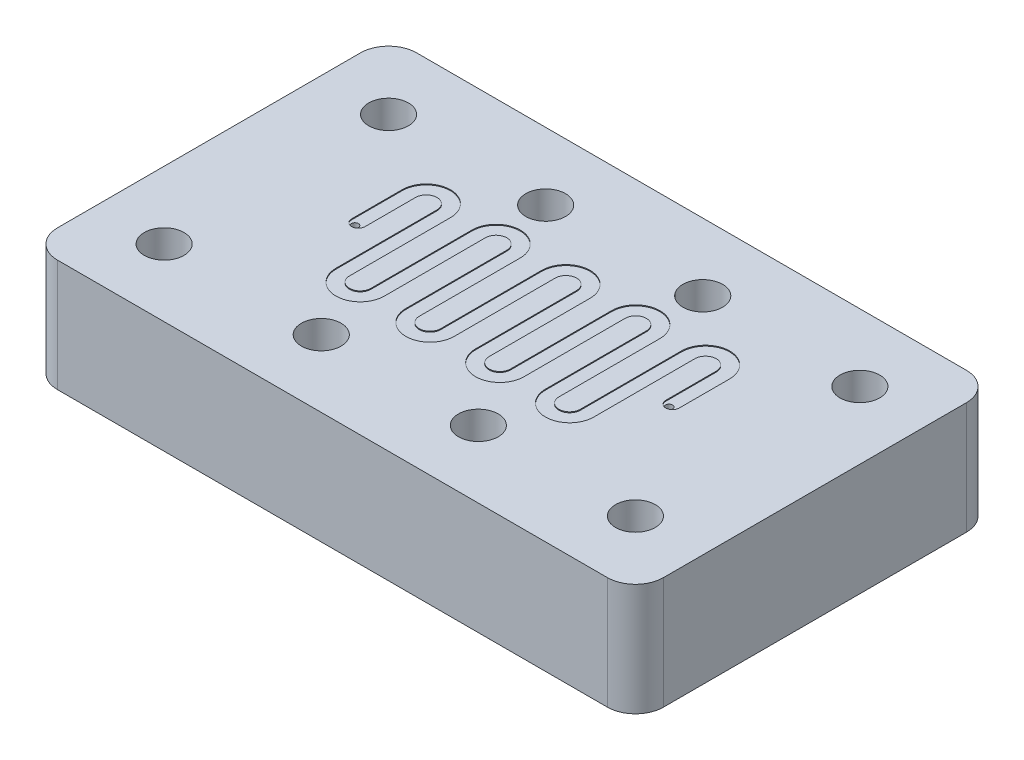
ISO-10303-21;
HEADER;
FILE_DESCRIPTION(('STEP AP214'),'2;1');
FILE_NAME('part.step','',(''),(''),'','','');
FILE_SCHEMA(('AUTOMOTIVE_DESIGN { 1 0 10303 214 1 1 1 1 }'));
ENDSEC;
DATA;
#1=APPLICATION_CONTEXT('core data for automotive mechanical design processes');
#2=APPLICATION_PROTOCOL_DEFINITION('international standard','automotive_design',2000,#1);
#3=PRODUCT_CONTEXT('',#1,'mechanical');
#4=PRODUCT('Part','Part','',(#3));
#5=PRODUCT_RELATED_PRODUCT_CATEGORY('part','',(#4));
#6=PRODUCT_DEFINITION_FORMATION('','',#4);
#7=PRODUCT_DEFINITION_CONTEXT('part definition',#1,'design');
#8=PRODUCT_DEFINITION('design','',#6,#7);
#9=PRODUCT_DEFINITION_SHAPE('','',#8);
#10=(LENGTH_UNIT() NAMED_UNIT(*) SI_UNIT(.MILLI.,.METRE.));
#11=(NAMED_UNIT(*) PLANE_ANGLE_UNIT() SI_UNIT($,.RADIAN.));
#12=(NAMED_UNIT(*) SI_UNIT($,.STERADIAN.) SOLID_ANGLE_UNIT());
#13=UNCERTAINTY_MEASURE_WITH_UNIT(LENGTH_MEASURE(1.E-05),#10,'distance_accuracy_value','');
#14=(GEOMETRIC_REPRESENTATION_CONTEXT(3) GLOBAL_UNCERTAINTY_ASSIGNED_CONTEXT((#13)) GLOBAL_UNIT_ASSIGNED_CONTEXT((#10,
#11,#12)) REPRESENTATION_CONTEXT('',''));
#15=CARTESIAN_POINT('',(0.,0.,0.));
#16=DIRECTION('',(0.,0.,1.));
#17=DIRECTION('',(1.,0.,0.));
#18=AXIS2_PLACEMENT_3D('',#15,#16,#17);
#19=CARTESIAN_POINT('',(-34.29,12.7,0.));
#20=DIRECTION('',(0.,1.,0.));
#21=DIRECTION('',(0.,0.,1.));
#22=AXIS2_PLACEMENT_3D('',#19,#20,#21);
#23=PLANE('',#22);
#24=DIRECTION('',(0.,0.,-1.));
#25=VECTOR('',#24,1.);
#26=CARTESIAN_POINT('',(10.6588598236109,12.7,-6.08280533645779));
#27=LINE('',#26,#25);
#28=CARTESIAN_POINT('',(10.6588598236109,12.7,5.34719466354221));
#29=VERTEX_POINT('',#28);
#30=CARTESIAN_POINT('',(10.6588598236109,12.7,-6.08280533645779));
#31=VERTEX_POINT('',#30);
#32=EDGE_CURVE('E372',#29,#31,#27,.T.);
#33=ORIENTED_EDGE('',*,*,#32,.F.);
#34=CARTESIAN_POINT('',(11.8724153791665,12.7,5.34719466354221));
#35=DIRECTION('',(0.,-1.,0.));
#36=DIRECTION('',(0.,0.,1.));
#37=AXIS2_PLACEMENT_3D('',#34,#35,#36);
#38=CIRCLE('',#37,1.21355555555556);
#39=CARTESIAN_POINT('',(13.085970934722,12.7,5.34719466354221));
#40=VERTEX_POINT('',#39);
#41=EDGE_CURVE('E384',#40,#29,#38,.T.);
#42=ORIENTED_EDGE('',*,*,#41,.F.);
#43=DIRECTION('',(0.,0.,1.));
#44=VECTOR('',#43,1.);
#45=CARTESIAN_POINT('',(13.085970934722,12.7,-0.367805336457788));
#46=LINE('',#45,#44);
#47=CARTESIAN_POINT('',(13.085970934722,12.7,-6.08280533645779));
#48=VERTEX_POINT('',#47);
#49=EDGE_CURVE('E460',#48,#40,#46,.T.);
#50=ORIENTED_EDGE('',*,*,#49,.F.);
#51=CARTESIAN_POINT('',(15.8235264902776,12.7,-6.08280533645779));
#52=DIRECTION('',(0.,1.,0.));
#53=DIRECTION('',(0.,0.,-1.));
#54=AXIS2_PLACEMENT_3D('',#51,#52,#53);
#55=CIRCLE('',#54,2.73755555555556);
#56=CARTESIAN_POINT('',(18.5610820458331,12.7,-6.08280533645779));
#57=VERTEX_POINT('',#56);
#58=EDGE_CURVE('E488',#57,#48,#55,.T.);
#59=ORIENTED_EDGE('',*,*,#58,.F.);
#60=DIRECTION('',(0.,0.,-1.));
#61=VECTOR('',#60,1.);
#62=CARTESIAN_POINT('',(18.5610820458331,12.7,-6.08280533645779));
#63=LINE('',#62,#61);
#64=CARTESIAN_POINT('',(18.5610820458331,12.7,-0.367805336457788));
#65=VERTEX_POINT('',#64);
#66=EDGE_CURVE('E485',#65,#57,#63,.T.);
#67=ORIENTED_EDGE('',*,*,#66,.F.);
#68=CARTESIAN_POINT('',(17.7990820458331,12.7,-0.367805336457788));
#69=DIRECTION('',(0.,1.,0.));
#70=DIRECTION('',(0.,0.,1.));
#71=AXIS2_PLACEMENT_3D('',#68,#69,#70);
#72=CIRCLE('',#71,0.762000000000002);
#73=CARTESIAN_POINT('',(17.0370820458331,12.7,-0.367805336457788));
#74=VERTEX_POINT('',#73);
#75=EDGE_CURVE('E483',#74,#65,#72,.T.);
#76=ORIENTED_EDGE('',*,*,#75,.F.);
#77=DIRECTION('',(0.,0.,1.));
#78=VECTOR('',#77,1.);
#79=CARTESIAN_POINT('',(17.0370820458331,12.7,-6.08280533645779));
#80=LINE('',#79,#78);
#81=CARTESIAN_POINT('',(17.0370820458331,12.7,-6.08280533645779));
#82=VERTEX_POINT('',#81);
#83=EDGE_CURVE('E480',#82,#74,#80,.T.);
#84=ORIENTED_EDGE('',*,*,#83,.F.);
#85=CARTESIAN_POINT('',(15.8235264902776,12.7,-6.08280533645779));
#86=DIRECTION('',(0.,-1.,0.));
#87=DIRECTION('',(0.,0.,-1.));
#88=AXIS2_PLACEMENT_3D('',#85,#86,#87);
#89=CIRCLE('',#88,1.21355555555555);
#90=CARTESIAN_POINT('',(14.609970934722,12.7,-6.08280533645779));
#91=VERTEX_POINT('',#90);
#92=EDGE_CURVE('E477',#91,#82,#89,.T.);
#93=ORIENTED_EDGE('',*,*,#92,.F.);
#94=DIRECTION('',(0.,0.,-1.));
#95=VECTOR('',#94,1.);
#96=CARTESIAN_POINT('',(14.609970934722,12.7,-0.367805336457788));
#97=LINE('',#96,#95);
#98=CARTESIAN_POINT('',(14.609970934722,12.7,5.34719466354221));
#99=VERTEX_POINT('',#98);
#100=EDGE_CURVE('E389',#99,#91,#97,.T.);
#101=ORIENTED_EDGE('',*,*,#100,.F.);
#102=CARTESIAN_POINT('',(11.8724153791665,12.7,5.34719466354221));
#103=DIRECTION('',(0.,1.,0.));
#104=DIRECTION('',(0.,0.,1.));
#105=AXIS2_PLACEMENT_3D('',#102,#103,#104);
#106=CIRCLE('',#105,2.73755555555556);
#107=CARTESIAN_POINT('',(9.13485982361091,12.7,5.34719466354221));
#108=VERTEX_POINT('',#107);
#109=EDGE_CURVE('E380',#108,#99,#106,.T.);
#110=ORIENTED_EDGE('',*,*,#109,.F.);
#111=DIRECTION('',(0.,0.,1.));
#112=VECTOR('',#111,1.);
#113=CARTESIAN_POINT('',(9.13485982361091,12.7,-6.08280533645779));
#114=LINE('',#113,#112);
#115=CARTESIAN_POINT('',(9.13485982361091,12.7,-6.08280533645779));
#116=VERTEX_POINT('',#115);
#117=EDGE_CURVE('E362',#116,#108,#114,.T.);
#118=ORIENTED_EDGE('',*,*,#117,.F.);
#119=CARTESIAN_POINT('',(7.92130426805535,12.7,-6.08280533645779));
#120=DIRECTION('',(0.,-1.,0.));
#121=DIRECTION('',(0.,0.,-1.));
#122=AXIS2_PLACEMENT_3D('',#119,#120,#121);
#123=CIRCLE('',#122,1.21355555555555);
#124=CARTESIAN_POINT('',(6.7077487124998,12.7,-6.08280533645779));
#125=VERTEX_POINT('',#124);
#126=EDGE_CURVE('E373',#125,#116,#123,.T.);
#127=ORIENTED_EDGE('',*,*,#126,.F.);
#128=DIRECTION('',(0.,0.,-1.));
#129=VECTOR('',#128,1.);
#130=CARTESIAN_POINT('',(6.7077487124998,12.7,-0.367805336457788));
#131=LINE('',#130,#129);
#132=CARTESIAN_POINT('',(6.7077487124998,12.7,5.34719466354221));
#133=VERTEX_POINT('',#132);
#134=EDGE_CURVE('E494',#133,#125,#131,.T.);
#135=ORIENTED_EDGE('',*,*,#134,.F.);
#136=CARTESIAN_POINT('',(3.97019315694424,12.7,5.34719466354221));
#137=DIRECTION('',(0.,1.,0.));
#138=DIRECTION('',(0.,0.,1.));
#139=AXIS2_PLACEMENT_3D('',#136,#137,#138);
#140=CIRCLE('',#139,2.73755555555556);
#141=CARTESIAN_POINT('',(1.23263760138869,12.7,5.34719466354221));
#142=VERTEX_POINT('',#141);
#143=EDGE_CURVE('E416',#142,#133,#140,.T.);
#144=ORIENTED_EDGE('',*,*,#143,.F.);
#145=DIRECTION('',(0.,0.,1.));
#146=VECTOR('',#145,1.);
#147=CARTESIAN_POINT('',(1.23263760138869,12.7,-6.08280533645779));
#148=LINE('',#147,#146);
#149=CARTESIAN_POINT('',(1.23263760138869,12.7,-6.08280533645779));
#150=VERTEX_POINT('',#149);
#151=EDGE_CURVE('E562',#150,#142,#148,.T.);
#152=ORIENTED_EDGE('',*,*,#151,.F.);
#153=CARTESIAN_POINT('',(0.0190820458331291,12.7,-6.08280533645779));
#154=DIRECTION('',(0.,-1.,0.));
#155=DIRECTION('',(0.,0.,-1.));
#156=AXIS2_PLACEMENT_3D('',#153,#154,#155);
#157=CIRCLE('',#156,1.21355555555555);
#158=CARTESIAN_POINT('',(-1.19447350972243,12.7,-6.08280533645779));
#159=VERTEX_POINT('',#158);
#160=EDGE_CURVE('E559',#159,#150,#157,.T.);
#161=ORIENTED_EDGE('',*,*,#160,.F.);
#162=DIRECTION('',(0.,0.,-1.));
#163=VECTOR('',#162,1.);
#164=CARTESIAN_POINT('',(-1.19447350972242,12.7,-0.367805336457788));
#165=LINE('',#164,#163);
#166=CARTESIAN_POINT('',(-1.19447350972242,12.7,5.34719466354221));
#167=VERTEX_POINT('',#166);
#168=EDGE_CURVE('E534',#167,#159,#165,.T.);
#169=ORIENTED_EDGE('',*,*,#168,.F.);
#170=CARTESIAN_POINT('',(-3.93202906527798,12.7,5.34719466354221));
#171=DIRECTION('',(0.,1.,0.));
#172=DIRECTION('',(0.,0.,1.));
#173=AXIS2_PLACEMENT_3D('',#170,#171,#172);
#174=CIRCLE('',#173,2.73755555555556);
#175=CARTESIAN_POINT('',(-6.66958462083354,12.7,5.34719466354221));
#176=VERTEX_POINT('',#175);
#177=EDGE_CURVE('E415',#176,#167,#174,.T.);
#178=ORIENTED_EDGE('',*,*,#177,.F.);
#179=DIRECTION('',(0.,0.,1.));
#180=VECTOR('',#179,1.);
#181=CARTESIAN_POINT('',(-6.66958462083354,12.7,-6.08280533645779));
#182=LINE('',#181,#180);
#183=CARTESIAN_POINT('',(-6.66958462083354,12.7,-6.08280533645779));
#184=VERTEX_POINT('',#183);
#185=EDGE_CURVE('E594',#184,#176,#182,.T.);
#186=ORIENTED_EDGE('',*,*,#185,.F.);
#187=CARTESIAN_POINT('',(-7.88314017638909,12.7,-6.08280533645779));
#188=DIRECTION('',(0.,-1.,0.));
#189=DIRECTION('',(0.,0.,-1.));
#190=AXIS2_PLACEMENT_3D('',#187,#188,#189);
#191=CIRCLE('',#190,1.21355555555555);
#192=CARTESIAN_POINT('',(-9.09669573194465,12.7,-6.08280533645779));
#193=VERTEX_POINT('',#192);
#194=EDGE_CURVE('E573',#193,#184,#191,.T.);
#195=ORIENTED_EDGE('',*,*,#194,.F.);
#196=DIRECTION('',(0.,0.,-1.));
#197=VECTOR('',#196,1.);
#198=CARTESIAN_POINT('',(-9.09669573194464,12.7,-0.367805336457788));
#199=LINE('',#198,#197);
#200=CARTESIAN_POINT('',(-9.09669573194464,12.7,5.34719466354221));
#201=VERTEX_POINT('',#200);
#202=EDGE_CURVE('E623',#201,#193,#199,.T.);
#203=ORIENTED_EDGE('',*,*,#202,.F.);
#204=CARTESIAN_POINT('',(-11.8342512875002,12.7,5.34719466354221));
#205=DIRECTION('',(0.,1.,0.));
#206=DIRECTION('',(0.,0.,1.));
#207=AXIS2_PLACEMENT_3D('',#204,#205,#206);
#208=CIRCLE('',#207,2.73755555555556);
#209=CARTESIAN_POINT('',(-14.5718068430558,12.7,5.34719466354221));
#210=VERTEX_POINT('',#209);
#211=EDGE_CURVE('E604',#210,#201,#208,.T.);
#212=ORIENTED_EDGE('',*,*,#211,.F.);
#213=DIRECTION('',(0.,0.,1.));
#214=VECTOR('',#213,1.);
#215=CARTESIAN_POINT('',(-14.5718068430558,12.7,-6.08280533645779));
#216=LINE('',#215,#214);
#217=CARTESIAN_POINT('',(-14.5718068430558,12.7,-6.08280533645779));
#218=VERTEX_POINT('',#217);
#219=EDGE_CURVE('E668',#218,#210,#216,.T.);
#220=ORIENTED_EDGE('',*,*,#219,.F.);
#221=CARTESIAN_POINT('',(-15.7853623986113,12.7,-6.08280533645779));
#222=DIRECTION('',(0.,-1.,0.));
#223=DIRECTION('',(0.,0.,-1.));
#224=AXIS2_PLACEMENT_3D('',#221,#222,#223);
#225=CIRCLE('',#224,1.21355555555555);
#226=CARTESIAN_POINT('',(-16.9989179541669,12.7,-6.08280533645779));
#227=VERTEX_POINT('',#226);
#228=EDGE_CURVE('E665',#227,#218,#225,.T.);
#229=ORIENTED_EDGE('',*,*,#228,.F.);
#230=DIRECTION('',(0.,0.,-1.));
#231=VECTOR('',#230,1.);
#232=CARTESIAN_POINT('',(-16.9989179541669,12.7,-0.367805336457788));
#233=LINE('',#232,#231);
#234=CARTESIAN_POINT('',(-16.9989179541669,12.7,-0.367805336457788));
#235=VERTEX_POINT('',#234);
#236=EDGE_CURVE('E662',#235,#227,#233,.T.);
#237=ORIENTED_EDGE('',*,*,#236,.F.);
#238=CARTESIAN_POINT('',(-17.7609179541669,12.7,-0.367805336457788));
#239=DIRECTION('',(0.,1.,0.));
#240=DIRECTION('',(0.,0.,1.));
#241=AXIS2_PLACEMENT_3D('',#238,#239,#240);
#242=CIRCLE('',#241,0.762000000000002);
#243=CARTESIAN_POINT('',(-18.5229179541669,12.7,-0.367805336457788));
#244=VERTEX_POINT('',#243);
#245=EDGE_CURVE('E71',#244,#235,#242,.T.);
#246=ORIENTED_EDGE('',*,*,#245,.F.);
#247=DIRECTION('',(0.,0.,1.));
#248=VECTOR('',#247,1.);
#249=CARTESIAN_POINT('',(-18.5229179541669,12.7,-0.367805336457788));
#250=LINE('',#249,#248);
#251=CARTESIAN_POINT('',(-18.5229179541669,12.7,-6.08280533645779));
#252=VERTEX_POINT('',#251);
#253=EDGE_CURVE('E676',#252,#244,#250,.T.);
#254=ORIENTED_EDGE('',*,*,#253,.F.);
#255=CARTESIAN_POINT('',(-15.7853623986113,12.7,-6.08280533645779));
#256=DIRECTION('',(0.,1.,0.));
#257=DIRECTION('',(0.,0.,-1.));
#258=AXIS2_PLACEMENT_3D('',#255,#256,#257);
#259=CIRCLE('',#258,2.73755555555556);
#260=CARTESIAN_POINT('',(-13.0478068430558,12.7,-6.08280533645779));
#261=VERTEX_POINT('',#260);
#262=EDGE_CURVE('E673',#261,#252,#259,.T.);
#263=ORIENTED_EDGE('',*,*,#262,.F.);
#264=DIRECTION('',(0.,0.,-1.));
#265=VECTOR('',#264,1.);
#266=CARTESIAN_POINT('',(-13.0478068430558,12.7,-6.08280533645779));
#267=LINE('',#266,#265);
#268=CARTESIAN_POINT('',(-13.0478068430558,12.7,5.34719466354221));
#269=VERTEX_POINT('',#268);
#270=EDGE_CURVE('E670',#269,#261,#267,.T.);
#271=ORIENTED_EDGE('',*,*,#270,.F.);
#272=CARTESIAN_POINT('',(-11.8342512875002,12.7,5.34719466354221));
#273=DIRECTION('',(0.,-1.,0.));
#274=DIRECTION('',(0.,0.,1.));
#275=AXIS2_PLACEMENT_3D('',#272,#273,#274);
#276=CIRCLE('',#275,1.21355555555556);
#277=CARTESIAN_POINT('',(-10.6206957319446,12.7,5.34719466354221));
#278=VERTEX_POINT('',#277);
#279=EDGE_CURVE('E628',#278,#269,#276,.T.);
#280=ORIENTED_EDGE('',*,*,#279,.F.);
#281=DIRECTION('',(0.,0.,1.));
#282=VECTOR('',#281,1.);
#283=CARTESIAN_POINT('',(-10.6206957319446,12.7,-0.367805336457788));
#284=LINE('',#283,#282);
#285=CARTESIAN_POINT('',(-10.6206957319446,12.7,-6.08280533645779));
#286=VERTEX_POINT('',#285);
#287=EDGE_CURVE('E625',#286,#278,#284,.T.);
#288=ORIENTED_EDGE('',*,*,#287,.F.);
#289=CARTESIAN_POINT('',(-7.88314017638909,12.7,-6.08280533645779));
#290=DIRECTION('',(0.,1.,0.));
#291=DIRECTION('',(0.,0.,-1.));
#292=AXIS2_PLACEMENT_3D('',#289,#290,#291);
#293=CIRCLE('',#292,2.73755555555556);
#294=CARTESIAN_POINT('',(-5.14558462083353,12.7,-6.08280533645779));
#295=VERTEX_POINT('',#294);
#296=EDGE_CURVE('E583',#295,#286,#293,.T.);
#297=ORIENTED_EDGE('',*,*,#296,.F.);
#298=DIRECTION('',(0.,0.,-1.));
#299=VECTOR('',#298,1.);
#300=CARTESIAN_POINT('',(-5.14558462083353,12.7,-6.08280533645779));
#301=LINE('',#300,#299);
#302=CARTESIAN_POINT('',(-5.14558462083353,12.7,5.34719466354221));
#303=VERTEX_POINT('',#302);
#304=EDGE_CURVE('E596',#303,#295,#301,.T.);
#305=ORIENTED_EDGE('',*,*,#304,.F.);
#306=CARTESIAN_POINT('',(-3.93202906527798,12.7,5.34719466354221));
#307=DIRECTION('',(0.,-1.,0.));
#308=DIRECTION('',(0.,0.,1.));
#309=AXIS2_PLACEMENT_3D('',#306,#307,#308);
#310=CIRCLE('',#309,1.21355555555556);
#311=CARTESIAN_POINT('',(-2.71847350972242,12.7,5.34719466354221));
#312=VERTEX_POINT('',#311);
#313=EDGE_CURVE('E442',#312,#303,#310,.T.);
#314=ORIENTED_EDGE('',*,*,#313,.F.);
#315=DIRECTION('',(0.,0.,1.));
#316=VECTOR('',#315,1.);
#317=CARTESIAN_POINT('',(-2.71847350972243,12.7,-0.367805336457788));
#318=LINE('',#317,#316);
#319=CARTESIAN_POINT('',(-2.71847350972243,12.7,-6.08280533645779));
#320=VERTEX_POINT('',#319);
#321=EDGE_CURVE('E543',#320,#312,#318,.T.);
#322=ORIENTED_EDGE('',*,*,#321,.F.);
#323=CARTESIAN_POINT('',(0.0190820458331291,12.7,-6.08280533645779));
#324=DIRECTION('',(0.,1.,0.));
#325=DIRECTION('',(0.,0.,-1.));
#326=AXIS2_PLACEMENT_3D('',#323,#324,#325);
#327=CIRCLE('',#326,2.73755555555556);
#328=CARTESIAN_POINT('',(2.75663760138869,12.7,-6.08280533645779));
#329=VERTEX_POINT('',#328);
#330=EDGE_CURVE('E567',#329,#320,#327,.T.);
#331=ORIENTED_EDGE('',*,*,#330,.F.);
#332=DIRECTION('',(0.,0.,-1.));
#333=VECTOR('',#332,1.);
#334=CARTESIAN_POINT('',(2.75663760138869,12.7,-6.08280533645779));
#335=LINE('',#334,#333);
#336=CARTESIAN_POINT('',(2.75663760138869,12.7,5.34719466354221));
#337=VERTEX_POINT('',#336);
#338=EDGE_CURVE('E564',#337,#329,#335,.T.);
#339=ORIENTED_EDGE('',*,*,#338,.F.);
#340=CARTESIAN_POINT('',(3.97019315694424,12.7,5.34719466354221));
#341=DIRECTION('',(0.,-1.,0.));
#342=DIRECTION('',(0.,0.,1.));
#343=AXIS2_PLACEMENT_3D('',#340,#341,#342);
#344=CIRCLE('',#343,1.21355555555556);
#345=CARTESIAN_POINT('',(5.1837487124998,12.7,5.34719466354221));
#346=VERTEX_POINT('',#345);
#347=EDGE_CURVE('E419',#346,#337,#344,.T.);
#348=ORIENTED_EDGE('',*,*,#347,.F.);
#349=DIRECTION('',(0.,0.,1.));
#350=VECTOR('',#349,1.);
#351=CARTESIAN_POINT('',(5.1837487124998,12.7,-0.367805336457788));
#352=LINE('',#351,#350);
#353=CARTESIAN_POINT('',(5.1837487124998,12.7,-6.08280533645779));
#354=VERTEX_POINT('',#353);
#355=EDGE_CURVE('E509',#354,#346,#352,.T.);
#356=ORIENTED_EDGE('',*,*,#355,.F.);
#357=CARTESIAN_POINT('',(7.92130426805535,12.7,-6.08280533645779));
#358=DIRECTION('',(0.,1.,0.));
#359=DIRECTION('',(0.,0.,-1.));
#360=AXIS2_PLACEMENT_3D('',#357,#358,#359);
#361=CIRCLE('',#360,2.73755555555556);
#362=EDGE_CURVE('E528',#31,#354,#361,.T.);
#363=ORIENTED_EDGE('',*,*,#362,.F.);
#364=EDGE_LOOP('',(#33,#42,#50,#59,#67,#76,#84,#93,#101,#110,#118,#127,#135,#144,#152,#161,#169,
#178,#186,#195,#203,#212,#220,#229,#237,#246,#254,#263,#271,#280,#288,#297,#305,#314,#322,#331,
#339,#348,#356,#363));
#365=FACE_BOUND('',#364,.T.);
#366=CARTESIAN_POINT('',(-8.89,12.7,12.7));
#367=DIRECTION('',(0.,-1.,0.));
#368=DIRECTION('',(0.,0.,-1.));
#369=AXIS2_PLACEMENT_3D('',#366,#367,#368);
#370=CIRCLE('',#369,2.2479);
#371=CARTESIAN_POINT('',(-8.89,12.7,10.4521));
#372=VERTEX_POINT('',#371);
#373=EDGE_CURVE('E694',#372,#372,#370,.T.);
#374=ORIENTED_EDGE('',*,*,#373,.T.);
#375=EDGE_LOOP('',(#374));
#376=FACE_BOUND('',#375,.T.);
#377=CARTESIAN_POINT('',(26.67,12.7,-12.7));
#378=DIRECTION('',(0.,-1.,0.));
#379=DIRECTION('',(0.,0.,1.));
#380=AXIS2_PLACEMENT_3D('',#377,#378,#379);
#381=CIRCLE('',#380,2.2479);
#382=CARTESIAN_POINT('',(26.67,12.7,-10.4521));
#383=VERTEX_POINT('',#382);
#384=EDGE_CURVE('E712',#383,#383,#381,.T.);
#385=ORIENTED_EDGE('',*,*,#384,.T.);
#386=EDGE_LOOP('',(#385));
#387=FACE_BOUND('',#386,.T.);
#388=CARTESIAN_POINT('',(-8.89,12.7,-12.7));
#389=DIRECTION('',(0.,1.,0.));
#390=DIRECTION('',(0.,0.,1.));
#391=AXIS2_PLACEMENT_3D('',#388,#389,#390);
#392=CIRCLE('',#391,2.2479);
#393=CARTESIAN_POINT('',(-8.89,12.7,-10.4521));
#394=VERTEX_POINT('',#393);
#395=EDGE_CURVE('E740',#394,#394,#392,.T.);
#396=ORIENTED_EDGE('',*,*,#395,.F.);
#397=EDGE_LOOP('',(#396));
#398=FACE_BOUND('',#397,.T.);
#399=CARTESIAN_POINT('',(-26.67,12.7,-12.7));
#400=DIRECTION('',(0.,1.,0.));
#401=DIRECTION('',(0.,0.,1.));
#402=AXIS2_PLACEMENT_3D('',#399,#400,#401);
#403=CIRCLE('',#402,2.2479);
#404=CARTESIAN_POINT('',(-26.67,12.7,-10.4521));
#405=VERTEX_POINT('',#404);
#406=EDGE_CURVE('E737',#405,#405,#403,.T.);
#407=ORIENTED_EDGE('',*,*,#406,.F.);
#408=EDGE_LOOP('',(#407));
#409=FACE_BOUND('',#408,.T.);
#410=CARTESIAN_POINT('',(8.89,12.7,-12.7));
#411=DIRECTION('',(0.,-1.,0.));
#412=DIRECTION('',(0.,0.,1.));
#413=AXIS2_PLACEMENT_3D('',#410,#411,#412);
#414=CIRCLE('',#413,2.2479);
#415=CARTESIAN_POINT('',(8.89,12.7,-10.4521));
#416=VERTEX_POINT('',#415);
#417=EDGE_CURVE('E718',#416,#416,#414,.T.);
#418=ORIENTED_EDGE('',*,*,#417,.T.);
#419=EDGE_LOOP('',(#418));
#420=FACE_BOUND('',#419,.T.);
#421=CARTESIAN_POINT('',(8.89,12.7,12.7));
#422=DIRECTION('',(0.,1.,0.));
#423=DIRECTION('',(0.,0.,-1.));
#424=AXIS2_PLACEMENT_3D('',#421,#422,#423);
#425=CIRCLE('',#424,2.2479);
#426=CARTESIAN_POINT('',(8.89,12.7,10.4521));
#427=VERTEX_POINT('',#426);
#428=EDGE_CURVE('E706',#427,#427,#425,.T.);
#429=ORIENTED_EDGE('',*,*,#428,.F.);
#430=EDGE_LOOP('',(#429));
#431=FACE_BOUND('',#430,.T.);
#432=CARTESIAN_POINT('',(26.67,12.7,12.7));
#433=DIRECTION('',(0.,1.,0.));
#434=DIRECTION('',(0.,0.,-1.));
#435=AXIS2_PLACEMENT_3D('',#432,#433,#434);
#436=CIRCLE('',#435,2.2479);
#437=CARTESIAN_POINT('',(26.67,12.7,10.4521));
#438=VERTEX_POINT('',#437);
#439=EDGE_CURVE('E700',#438,#438,#436,.T.);
#440=ORIENTED_EDGE('',*,*,#439,.F.);
#441=EDGE_LOOP('',(#440));
#442=FACE_BOUND('',#441,.T.);
#443=DIRECTION('',(0.,0.,1.));
#444=VECTOR('',#443,1.);
#445=CARTESIAN_POINT('',(-34.29,12.7,-20.32));
#446=LINE('',#445,#444);
#447=CARTESIAN_POINT('',(-34.29,12.7,-17.145));
#448=VERTEX_POINT('',#447);
#449=CARTESIAN_POINT('',(-34.29,12.7,17.145));
#450=VERTEX_POINT('',#449);
#451=EDGE_CURVE('E747',#448,#450,#446,.T.);
#452=ORIENTED_EDGE('',*,*,#451,.T.);
#453=CARTESIAN_POINT('',(-31.115,12.7,17.145));
#454=DIRECTION('',(0.,1.,0.));
#455=DIRECTION('',(0.,0.,1.));
#456=AXIS2_PLACEMENT_3D('',#453,#454,#455);
#457=CIRCLE('',#456,3.175);
#458=CARTESIAN_POINT('',(-31.115,12.7,20.32));
#459=VERTEX_POINT('',#458);
#460=EDGE_CURVE('E796',#450,#459,#457,.T.);
#461=ORIENTED_EDGE('',*,*,#460,.T.);
#462=DIRECTION('',(-1.,0.,0.));
#463=VECTOR('',#462,1.);
#464=CARTESIAN_POINT('',(-34.29,12.7,20.32));
#465=LINE('',#464,#463);
#466=CARTESIAN_POINT('',(31.115,12.7,20.32));
#467=VERTEX_POINT('',#466);
#468=EDGE_CURVE('E729',#467,#459,#465,.T.);
#469=ORIENTED_EDGE('',*,*,#468,.F.);
#470=CARTESIAN_POINT('',(31.115,12.7,17.145));
#471=DIRECTION('',(0.,1.,0.));
#472=DIRECTION('',(0.,0.,1.));
#473=AXIS2_PLACEMENT_3D('',#470,#471,#472);
#474=CIRCLE('',#473,3.175);
#475=CARTESIAN_POINT('',(34.29,12.7,17.145));
#476=VERTEX_POINT('',#475);
#477=EDGE_CURVE('E787',#467,#476,#474,.T.);
#478=ORIENTED_EDGE('',*,*,#477,.T.);
#479=DIRECTION('',(0.,0.,1.));
#480=VECTOR('',#479,1.);
#481=CARTESIAN_POINT('',(34.29,12.7,-20.32));
#482=LINE('',#481,#480);
#483=CARTESIAN_POINT('',(34.29,12.7,-17.145));
#484=VERTEX_POINT('',#483);
#485=EDGE_CURVE('E722',#484,#476,#482,.T.);
#486=ORIENTED_EDGE('',*,*,#485,.F.);
#487=CARTESIAN_POINT('',(31.115,12.7,-17.145));
#488=DIRECTION('',(0.,1.,0.));
#489=DIRECTION('',(0.,0.,1.));
#490=AXIS2_PLACEMENT_3D('',#487,#488,#489);
#491=CIRCLE('',#490,3.175);
#492=CARTESIAN_POINT('',(31.115,12.7,-20.32));
#493=VERTEX_POINT('',#492);
#494=EDGE_CURVE('E778',#484,#493,#491,.T.);
#495=ORIENTED_EDGE('',*,*,#494,.T.);
#496=DIRECTION('',(-1.,0.,0.));
#497=VECTOR('',#496,1.);
#498=CARTESIAN_POINT('',(-34.29,12.7,-20.32));
#499=LINE('',#498,#497);
#500=CARTESIAN_POINT('',(-31.115,12.7,-20.32));
#501=VERTEX_POINT('',#500);
#502=EDGE_CURVE('E750',#493,#501,#499,.T.);
#503=ORIENTED_EDGE('',*,*,#502,.T.);
#504=CARTESIAN_POINT('',(-31.115,12.7,-17.145));
#505=DIRECTION('',(0.,1.,0.));
#506=DIRECTION('',(0.,0.,1.));
#507=AXIS2_PLACEMENT_3D('',#504,#505,#506);
#508=CIRCLE('',#507,3.175);
#509=EDGE_CURVE('E765',#501,#448,#508,.T.);
#510=ORIENTED_EDGE('',*,*,#509,.T.);
#511=EDGE_LOOP('',(#452,#461,#469,#478,#486,#495,#503,#510));
#512=FACE_BOUND('',#511,.T.);
#513=CARTESIAN_POINT('',(-26.67,12.7,12.7));
#514=DIRECTION('',(0.,-1.,0.));
#515=DIRECTION('',(0.,0.,-1.));
#516=AXIS2_PLACEMENT_3D('',#513,#514,#515);
#517=CIRCLE('',#516,2.2479);
#518=CARTESIAN_POINT('',(-26.67,12.7,10.4521));
#519=VERTEX_POINT('',#518);
#520=EDGE_CURVE('E681',#519,#519,#517,.T.);
#521=ORIENTED_EDGE('',*,*,#520,.T.);
#522=EDGE_LOOP('',(#521));
#523=FACE_BOUND('',#522,.T.);
#524=ADVANCED_FACE('F46',(#365,#376,#387,#398,#409,#420,#431,#442,#512,#523),#23,.T.);
#525=CARTESIAN_POINT('',(-34.29,0.,0.));
#526=DIRECTION('',(0.,1.,0.));
#527=DIRECTION('',(0.,0.,1.));
#528=AXIS2_PLACEMENT_3D('',#525,#526,#527);
#529=PLANE('',#528);
#530=CARTESIAN_POINT('',(17.78,0.,0.));
#531=DIRECTION('',(0.,1.,0.));
#532=DIRECTION('',(0.,0.,1.));
#533=AXIS2_PLACEMENT_3D('',#530,#531,#532);
#534=CIRCLE('',#533,2.0193);
#535=CARTESIAN_POINT('',(17.78,0.,2.0193));
#536=VERTEX_POINT('',#535);
#537=EDGE_CURVE('E1567',#536,#536,#534,.T.);
#538=ORIENTED_EDGE('',*,*,#537,.T.);
#539=EDGE_LOOP('',(#538));
#540=FACE_BOUND('',#539,.T.);
#541=CARTESIAN_POINT('',(-17.78,0.,0.));
#542=DIRECTION('',(0.,1.,0.));
#543=DIRECTION('',(0.,0.,1.));
#544=AXIS2_PLACEMENT_3D('',#541,#542,#543);
#545=CIRCLE('',#544,2.0193);
#546=CARTESIAN_POINT('',(-17.78,0.,2.0193));
#547=VERTEX_POINT('',#546);
#548=EDGE_CURVE('E1583',#547,#547,#545,.T.);
#549=ORIENTED_EDGE('',*,*,#548,.T.);
#550=EDGE_LOOP('',(#549));
#551=FACE_BOUND('',#550,.T.);
#552=CARTESIAN_POINT('',(-8.89,0.,12.7));
#553=DIRECTION('',(0.,-1.,0.));
#554=DIRECTION('',(0.,0.,-1.));
#555=AXIS2_PLACEMENT_3D('',#552,#553,#554);
#556=CIRCLE('',#555,2.2479);
#557=CARTESIAN_POINT('',(-8.89,0.,10.4521));
#558=VERTEX_POINT('',#557);
#559=EDGE_CURVE('E697',#558,#558,#556,.T.);
#560=ORIENTED_EDGE('',*,*,#559,.F.);
#561=EDGE_LOOP('',(#560));
#562=FACE_BOUND('',#561,.T.);
#563=CARTESIAN_POINT('',(26.67,0.,12.7));
#564=DIRECTION('',(0.,1.,0.));
#565=DIRECTION('',(0.,0.,-1.));
#566=AXIS2_PLACEMENT_3D('',#563,#564,#565);
#567=CIRCLE('',#566,2.2479);
#568=CARTESIAN_POINT('',(26.67,0.,10.4521));
#569=VERTEX_POINT('',#568);
#570=EDGE_CURVE('E703',#569,#569,#567,.T.);
#571=ORIENTED_EDGE('',*,*,#570,.T.);
#572=EDGE_LOOP('',(#571));
#573=FACE_BOUND('',#572,.T.);
#574=CARTESIAN_POINT('',(8.89,0.,12.7));
#575=DIRECTION('',(0.,1.,0.));
#576=DIRECTION('',(0.,0.,-1.));
#577=AXIS2_PLACEMENT_3D('',#574,#575,#576);
#578=CIRCLE('',#577,2.2479);
#579=CARTESIAN_POINT('',(8.89,0.,10.4521));
#580=VERTEX_POINT('',#579);
#581=EDGE_CURVE('E709',#580,#580,#578,.T.);
#582=ORIENTED_EDGE('',*,*,#581,.T.);
#583=EDGE_LOOP('',(#582));
#584=FACE_BOUND('',#583,.T.);
#585=CARTESIAN_POINT('',(8.89,0.,-12.7));
#586=DIRECTION('',(0.,1.,0.));
#587=DIRECTION('',(0.,0.,1.));
#588=AXIS2_PLACEMENT_3D('',#585,#586,#587);
#589=CIRCLE('',#588,2.2479);
#590=CARTESIAN_POINT('',(8.89,0.,-10.4521));
#591=VERTEX_POINT('',#590);
#592=EDGE_CURVE('E721',#591,#591,#589,.F.);
#593=ORIENTED_EDGE('',*,*,#592,.F.);
#594=EDGE_LOOP('',(#593));
#595=FACE_BOUND('',#594,.T.);
#596=CARTESIAN_POINT('',(-26.67,0.,-12.7));
#597=DIRECTION('',(0.,1.,0.));
#598=DIRECTION('',(0.,0.,1.));
#599=AXIS2_PLACEMENT_3D('',#596,#597,#598);
#600=CIRCLE('',#599,2.2479);
#601=CARTESIAN_POINT('',(-26.67,0.,-10.4521));
#602=VERTEX_POINT('',#601);
#603=EDGE_CURVE('E732',#602,#602,#600,.T.);
#604=ORIENTED_EDGE('',*,*,#603,.T.);
#605=EDGE_LOOP('',(#604));
#606=FACE_BOUND('',#605,.T.);
#607=CARTESIAN_POINT('',(-8.89,0.,-12.7));
#608=DIRECTION('',(0.,1.,0.));
#609=DIRECTION('',(0.,0.,1.));
#610=AXIS2_PLACEMENT_3D('',#607,#608,#609);
#611=CIRCLE('',#610,2.2479);
#612=CARTESIAN_POINT('',(-8.89,0.,-10.4521));
#613=VERTEX_POINT('',#612);
#614=EDGE_CURVE('E741',#613,#613,#611,.T.);
#615=ORIENTED_EDGE('',*,*,#614,.T.);
#616=EDGE_LOOP('',(#615));
#617=FACE_BOUND('',#616,.T.);
#618=DIRECTION('',(-1.,0.,0.));
#619=VECTOR('',#618,1.);
#620=CARTESIAN_POINT('',(-34.29,0.,20.32));
#621=LINE('',#620,#619);
#622=CARTESIAN_POINT('',(31.115,0.,20.32));
#623=VERTEX_POINT('',#622);
#624=CARTESIAN_POINT('',(-31.115,0.,20.32));
#625=VERTEX_POINT('',#624);
#626=EDGE_CURVE('E725',#623,#625,#621,.T.);
#627=ORIENTED_EDGE('',*,*,#626,.T.);
#628=CARTESIAN_POINT('',(-31.115,0.,17.145));
#629=DIRECTION('',(0.,1.,0.));
#630=DIRECTION('',(0.,0.,1.));
#631=AXIS2_PLACEMENT_3D('',#628,#629,#630);
#632=CIRCLE('',#631,3.175);
#633=CARTESIAN_POINT('',(-34.29,0.,17.145));
#634=VERTEX_POINT('',#633);
#635=EDGE_CURVE('E792',#625,#634,#632,.F.);
#636=ORIENTED_EDGE('',*,*,#635,.T.);
#637=DIRECTION('',(0.,0.,1.));
#638=VECTOR('',#637,1.);
#639=CARTESIAN_POINT('',(-34.29,0.,-20.32));
#640=LINE('',#639,#638);
#641=CARTESIAN_POINT('',(-34.29,0.,-17.145));
#642=VERTEX_POINT('',#641);
#643=EDGE_CURVE('E744',#642,#634,#640,.T.);
#644=ORIENTED_EDGE('',*,*,#643,.F.);
#645=CARTESIAN_POINT('',(-31.115,0.,-17.145));
#646=DIRECTION('',(0.,1.,0.));
#647=DIRECTION('',(0.,0.,1.));
#648=AXIS2_PLACEMENT_3D('',#645,#646,#647);
#649=CIRCLE('',#648,3.175);
#650=CARTESIAN_POINT('',(-31.115,0.,-20.32));
#651=VERTEX_POINT('',#650);
#652=EDGE_CURVE('E759',#642,#651,#649,.F.);
#653=ORIENTED_EDGE('',*,*,#652,.T.);
#654=DIRECTION('',(-1.,0.,0.));
#655=VECTOR('',#654,1.);
#656=CARTESIAN_POINT('',(-34.29,0.,-20.32));
#657=LINE('',#656,#655);
#658=CARTESIAN_POINT('',(31.115,0.,-20.32));
#659=VERTEX_POINT('',#658);
#660=EDGE_CURVE('E751',#659,#651,#657,.T.);
#661=ORIENTED_EDGE('',*,*,#660,.F.);
#662=CARTESIAN_POINT('',(31.115,0.,-17.145));
#663=DIRECTION('',(0.,1.,0.));
#664=DIRECTION('',(0.,0.,1.));
#665=AXIS2_PLACEMENT_3D('',#662,#663,#664);
#666=CIRCLE('',#665,3.175);
#667=CARTESIAN_POINT('',(34.29,0.,-17.145));
#668=VERTEX_POINT('',#667);
#669=EDGE_CURVE('E774',#659,#668,#666,.F.);
#670=ORIENTED_EDGE('',*,*,#669,.T.);
#671=DIRECTION('',(0.,0.,1.));
#672=VECTOR('',#671,1.);
#673=CARTESIAN_POINT('',(34.29,0.,-20.32));
#674=LINE('',#673,#672);
#675=CARTESIAN_POINT('',(34.29,0.,17.145));
#676=VERTEX_POINT('',#675);
#677=EDGE_CURVE('E726',#668,#676,#674,.T.);
#678=ORIENTED_EDGE('',*,*,#677,.T.);
#679=CARTESIAN_POINT('',(31.115,0.,17.145));
#680=DIRECTION('',(0.,1.,0.));
#681=DIRECTION('',(0.,0.,1.));
#682=AXIS2_PLACEMENT_3D('',#679,#680,#681);
#683=CIRCLE('',#682,3.175);
#684=EDGE_CURVE('E783',#676,#623,#683,.F.);
#685=ORIENTED_EDGE('',*,*,#684,.T.);
#686=EDGE_LOOP('',(#627,#636,#644,#653,#661,#670,#678,#685));
#687=FACE_BOUND('',#686,.T.);
#688=CARTESIAN_POINT('',(26.67,0.,-12.7));
#689=DIRECTION('',(0.,1.,0.));
#690=DIRECTION('',(0.,0.,1.));
#691=AXIS2_PLACEMENT_3D('',#688,#689,#690);
#692=CIRCLE('',#691,2.2479);
#693=CARTESIAN_POINT('',(26.67,0.,-10.4521));
#694=VERTEX_POINT('',#693);
#695=EDGE_CURVE('E717',#694,#694,#692,.F.);
#696=ORIENTED_EDGE('',*,*,#695,.F.);
#697=EDGE_LOOP('',(#696));
#698=FACE_BOUND('',#697,.T.);
#699=CARTESIAN_POINT('',(-26.67,0.,12.7));
#700=DIRECTION('',(0.,-1.,0.));
#701=DIRECTION('',(0.,0.,-1.));
#702=AXIS2_PLACEMENT_3D('',#699,#700,#701);
#703=CIRCLE('',#702,2.2479);
#704=CARTESIAN_POINT('',(-26.67,0.,10.4521));
#705=VERTEX_POINT('',#704);
#706=EDGE_CURVE('E691',#705,#705,#703,.T.);
#707=ORIENTED_EDGE('',*,*,#706,.F.);
#708=EDGE_LOOP('',(#707));
#709=FACE_BOUND('',#708,.T.);
#710=ADVANCED_FACE('F823',(#540,#551,#562,#573,#584,#595,#606,#617,#687,#698,#709),#529,.F.);
#711=CARTESIAN_POINT('',(-34.29,12.7,-20.32));
#712=DIRECTION('',(1.,0.,0.));
#713=DIRECTION('',(0.,0.,-1.));
#714=AXIS2_PLACEMENT_3D('',#711,#712,#713);
#715=PLANE('',#714);
#716=ORIENTED_EDGE('',*,*,#643,.T.);
#717=DIRECTION('',(0.,-1.,0.));
#718=VECTOR('',#717,1.);
#719=CARTESIAN_POINT('',(-34.29,12.7,17.145));
#720=LINE('',#719,#718);
#721=EDGE_CURVE('E794',#634,#450,#720,.F.);
#722=ORIENTED_EDGE('',*,*,#721,.T.);
#723=ORIENTED_EDGE('',*,*,#451,.F.);
#724=DIRECTION('',(0.,-1.,0.));
#725=VECTOR('',#724,1.);
#726=CARTESIAN_POINT('',(-34.29,12.7,-17.145));
#727=LINE('',#726,#725);
#728=EDGE_CURVE('E753',#448,#642,#727,.T.);
#729=ORIENTED_EDGE('',*,*,#728,.T.);
#730=EDGE_LOOP('',(#716,#722,#723,#729));
#731=FACE_BOUND('',#730,.T.);
#732=ADVANCED_FACE('F827',(#731),#715,.F.);
#733=CARTESIAN_POINT('',(-34.29,12.7,-20.32));
#734=DIRECTION('',(0.,0.,1.));
#735=DIRECTION('',(1.,0.,0.));
#736=AXIS2_PLACEMENT_3D('',#733,#734,#735);
#737=PLANE('',#736);
#738=ORIENTED_EDGE('',*,*,#502,.F.);
#739=DIRECTION('',(0.,-1.,0.));
#740=VECTOR('',#739,1.);
#741=CARTESIAN_POINT('',(31.115,0.,-20.32));
#742=LINE('',#741,#740);
#743=EDGE_CURVE('E767',#493,#659,#742,.T.);
#744=ORIENTED_EDGE('',*,*,#743,.T.);
#745=ORIENTED_EDGE('',*,*,#660,.T.);
#746=DIRECTION('',(0.,-1.,0.));
#747=VECTOR('',#746,1.);
#748=CARTESIAN_POINT('',(-31.115,12.7,-20.32));
#749=LINE('',#748,#747);
#750=EDGE_CURVE('E762',#651,#501,#749,.F.);
#751=ORIENTED_EDGE('',*,*,#750,.T.);
#752=EDGE_LOOP('',(#738,#744,#745,#751));
#753=FACE_BOUND('',#752,.T.);
#754=ADVANCED_FACE('F831',(#753),#737,.F.);
#755=CARTESIAN_POINT('',(-8.89,0.,-12.7));
#756=DIRECTION('',(0.,1.,0.));
#757=DIRECTION('',(0.,0.,1.));
#758=AXIS2_PLACEMENT_3D('',#755,#756,#757);
#759=CYLINDRICAL_SURFACE('',#758,2.2479);
#760=ORIENTED_EDGE('',*,*,#614,.F.);
#761=EDGE_LOOP('',(#760));
#762=FACE_BOUND('',#761,.T.);
#763=ORIENTED_EDGE('',*,*,#395,.T.);
#764=EDGE_LOOP('',(#763));
#765=FACE_BOUND('',#764,.T.);
#766=ADVANCED_FACE('F834',(#762,#765),#759,.F.);
#767=CARTESIAN_POINT('',(-26.67,0.,-12.7));
#768=DIRECTION('',(0.,1.,0.));
#769=DIRECTION('',(0.,0.,1.));
#770=AXIS2_PLACEMENT_3D('',#767,#768,#769);
#771=CYLINDRICAL_SURFACE('',#770,2.2479);
#772=ORIENTED_EDGE('',*,*,#603,.F.);
#773=EDGE_LOOP('',(#772));
#774=FACE_BOUND('',#773,.T.);
#775=ORIENTED_EDGE('',*,*,#406,.T.);
#776=EDGE_LOOP('',(#775));
#777=FACE_BOUND('',#776,.T.);
#778=ADVANCED_FACE('F843',(#774,#777),#771,.F.);
#779=CARTESIAN_POINT('',(-31.115,12.7,-17.145));
#780=DIRECTION('',(0.,-1.,0.));
#781=DIRECTION('',(0.,0.,-1.));
#782=AXIS2_PLACEMENT_3D('',#779,#780,#781);
#783=CYLINDRICAL_SURFACE('',#782,3.175);
#784=ORIENTED_EDGE('',*,*,#509,.F.);
#785=ORIENTED_EDGE('',*,*,#750,.F.);
#786=ORIENTED_EDGE('',*,*,#652,.F.);
#787=ORIENTED_EDGE('',*,*,#728,.F.);
#788=EDGE_LOOP('',(#784,#785,#786,#787));
#789=FACE_BOUND('',#788,.T.);
#790=ADVANCED_FACE('F839',(#789),#783,.T.);
#791=CARTESIAN_POINT('',(-34.29,12.7,20.32));
#792=DIRECTION('',(0.,0.,1.));
#793=DIRECTION('',(1.,0.,0.));
#794=AXIS2_PLACEMENT_3D('',#791,#792,#793);
#795=PLANE('',#794);
#796=ORIENTED_EDGE('',*,*,#468,.T.);
#797=DIRECTION('',(0.,-1.,0.));
#798=VECTOR('',#797,1.);
#799=CARTESIAN_POINT('',(-31.115,0.,20.32));
#800=LINE('',#799,#798);
#801=EDGE_CURVE('E789',#459,#625,#800,.T.);
#802=ORIENTED_EDGE('',*,*,#801,.T.);
#803=ORIENTED_EDGE('',*,*,#626,.F.);
#804=DIRECTION('',(0.,-1.,0.));
#805=VECTOR('',#804,1.);
#806=CARTESIAN_POINT('',(31.115,12.7,20.32));
#807=LINE('',#806,#805);
#808=EDGE_CURVE('E785',#623,#467,#807,.F.);
#809=ORIENTED_EDGE('',*,*,#808,.T.);
#810=EDGE_LOOP('',(#796,#802,#803,#809));
#811=FACE_BOUND('',#810,.T.);
#812=ADVANCED_FACE('F842',(#811),#795,.T.);
#813=CARTESIAN_POINT('',(34.29,12.7,-20.32));
#814=DIRECTION('',(1.,0.,0.));
#815=DIRECTION('',(0.,0.,-1.));
#816=AXIS2_PLACEMENT_3D('',#813,#814,#815);
#817=PLANE('',#816);
#818=ORIENTED_EDGE('',*,*,#485,.T.);
#819=DIRECTION('',(0.,-1.,0.));
#820=VECTOR('',#819,1.);
#821=CARTESIAN_POINT('',(34.29,12.7,17.145));
#822=LINE('',#821,#820);
#823=EDGE_CURVE('E780',#476,#676,#822,.T.);
#824=ORIENTED_EDGE('',*,*,#823,.T.);
#825=ORIENTED_EDGE('',*,*,#677,.F.);
#826=DIRECTION('',(0.,-1.,0.));
#827=VECTOR('',#826,1.);
#828=CARTESIAN_POINT('',(34.29,12.7,-17.145));
#829=LINE('',#828,#827);
#830=EDGE_CURVE('E776',#668,#484,#829,.F.);
#831=ORIENTED_EDGE('',*,*,#830,.T.);
#832=EDGE_LOOP('',(#818,#824,#825,#831));
#833=FACE_BOUND('',#832,.T.);
#834=ADVANCED_FACE('F873',(#833),#817,.T.);
#835=CARTESIAN_POINT('',(8.89,-4.99999999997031E-05,-12.7));
#836=DIRECTION('',(0.,1.,0.));
#837=DIRECTION('',(0.,0.,1.));
#838=AXIS2_PLACEMENT_3D('',#835,#836,#837);
#839=CYLINDRICAL_SURFACE('',#838,2.2479);
#840=CARTESIAN_POINT('',(8.89,12.7,-10.4521));
#841=CARTESIAN_POINT('',(8.89,12.5677083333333,-10.4521));
#842=CARTESIAN_POINT('',(8.89,12.4354166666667,-10.4521));
#843=CARTESIAN_POINT('',(8.89,12.1708333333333,-10.4521));
#844=CARTESIAN_POINT('',(8.89,12.0385416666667,-10.4521));
#845=CARTESIAN_POINT('',(8.89,11.7739583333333,-10.4521));
#846=CARTESIAN_POINT('',(8.89,11.6416666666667,-10.4521));
#847=CARTESIAN_POINT('',(8.89,11.3770833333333,-10.4521));
#848=CARTESIAN_POINT('',(8.89,11.2447916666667,-10.4521));
#849=CARTESIAN_POINT('',(8.89,10.9802083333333,-10.4521));
#850=CARTESIAN_POINT('',(8.89,10.8479166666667,-10.4521));
#851=CARTESIAN_POINT('',(8.89,10.5833333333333,-10.4521));
#852=CARTESIAN_POINT('',(8.89,10.4510416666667,-10.4521));
#853=CARTESIAN_POINT('',(8.89,10.1864583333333,-10.4521));
#854=CARTESIAN_POINT('',(8.89,10.0541666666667,-10.4521));
#855=CARTESIAN_POINT('',(8.89,9.78958333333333,-10.4521));
#856=CARTESIAN_POINT('',(8.89,9.65729166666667,-10.4521));
#857=CARTESIAN_POINT('',(8.89,9.39270833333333,-10.4521));
#858=CARTESIAN_POINT('',(8.89,9.26041666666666,-10.4521));
#859=CARTESIAN_POINT('',(8.89,8.99583333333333,-10.4521));
#860=CARTESIAN_POINT('',(8.89,8.86354166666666,-10.4521));
#861=CARTESIAN_POINT('',(8.89,8.59895833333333,-10.4521));
#862=CARTESIAN_POINT('',(8.89,8.46666666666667,-10.4521));
#863=CARTESIAN_POINT('',(8.89,8.20208333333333,-10.4521));
#864=CARTESIAN_POINT('',(8.89,8.06979166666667,-10.4521));
#865=CARTESIAN_POINT('',(8.89,7.80520833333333,-10.4521));
#866=CARTESIAN_POINT('',(8.89,7.67291666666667,-10.4521));
#867=CARTESIAN_POINT('',(8.89,7.40833333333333,-10.4521));
#868=CARTESIAN_POINT('',(8.89,7.27604166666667,-10.4521));
#869=CARTESIAN_POINT('',(8.89,7.01145833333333,-10.4521));
#870=CARTESIAN_POINT('',(8.89,6.87916666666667,-10.4521));
#871=CARTESIAN_POINT('',(8.89,6.61458333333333,-10.4521));
#872=CARTESIAN_POINT('',(8.89,6.48229166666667,-10.4521));
#873=CARTESIAN_POINT('',(8.89,6.21770833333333,-10.4521));
#874=CARTESIAN_POINT('',(8.89,6.08541666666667,-10.4521));
#875=CARTESIAN_POINT('',(8.89,5.82083333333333,-10.4521));
#876=CARTESIAN_POINT('',(8.89,5.68854166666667,-10.4521));
#877=CARTESIAN_POINT('',(8.89,5.42395833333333,-10.4521));
#878=CARTESIAN_POINT('',(8.89,5.29166666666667,-10.4521));
#879=CARTESIAN_POINT('',(8.89,5.02708333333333,-10.4521));
#880=CARTESIAN_POINT('',(8.89,4.89479166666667,-10.4521));
#881=CARTESIAN_POINT('',(8.89,4.63020833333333,-10.4521));
#882=CARTESIAN_POINT('',(8.89,4.49791666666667,-10.4521));
#883=CARTESIAN_POINT('',(8.89,4.23333333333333,-10.4521));
#884=CARTESIAN_POINT('',(8.89,4.10104166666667,-10.4521));
#885=CARTESIAN_POINT('',(8.89,3.83645833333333,-10.4521));
#886=CARTESIAN_POINT('',(8.89,3.70416666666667,-10.4521));
#887=CARTESIAN_POINT('',(8.89,3.43958333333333,-10.4521));
#888=CARTESIAN_POINT('',(8.89,3.30729166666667,-10.4521));
#889=CARTESIAN_POINT('',(8.89,3.04270833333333,-10.4521));
#890=CARTESIAN_POINT('',(8.89,2.91041666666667,-10.4521));
#891=CARTESIAN_POINT('',(8.89,2.64583333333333,-10.4521));
#892=CARTESIAN_POINT('',(8.89,2.51354166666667,-10.4521));
#893=CARTESIAN_POINT('',(8.89,2.24895833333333,-10.4521));
#894=CARTESIAN_POINT('',(8.89,2.11666666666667,-10.4521));
#895=CARTESIAN_POINT('',(8.89,1.85208333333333,-10.4521));
#896=CARTESIAN_POINT('',(8.89,1.71979166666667,-10.4521));
#897=CARTESIAN_POINT('',(8.89,1.45520833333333,-10.4521));
#898=CARTESIAN_POINT('',(8.89,1.32291666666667,-10.4521));
#899=CARTESIAN_POINT('',(8.89,1.05833333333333,-10.4521));
#900=CARTESIAN_POINT('',(8.89,0.926041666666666,-10.4521));
#901=CARTESIAN_POINT('',(8.89,0.661458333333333,-10.4521));
#902=CARTESIAN_POINT('',(8.89,0.529166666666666,-10.4521));
#903=CARTESIAN_POINT('',(8.89,0.264583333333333,-10.4521));
#904=CARTESIAN_POINT('',(8.89,0.132291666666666,-10.4521));
#905=CARTESIAN_POINT('',(8.89,0.,-10.4521));
#906=B_SPLINE_CURVE_WITH_KNOTS('',3,(#840,#841,#842,#843,#844,#845,#846,#847,#848,#849,#850,
#851,#852,#853,#854,#855,#856,#857,#858,#859,#860,#861,#862,#863,#864,#865,#866,#867,#868,#869,
#870,#871,#872,#873,#874,#875,#876,#877,#878,#879,#880,#881,#882,#883,#884,#885,#886,#887,#888,
#889,#890,#891,#892,#893,#894,#895,#896,#897,#898,#899,#900,#901,#902,#903,#904,#905),
.UNSPECIFIED.,.F.,.F.,(4,2,2,2,2,2,2,2,2,2,2,2,2,2,2,2,2,2,2,2,2,2,2,2,2,2,2,2,2,2,2,2,4),(0.,
0.396875,0.793749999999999,1.190625,1.5875,1.984375,2.38125,2.778125,3.175,3.571875,3.96875,
4.365625,4.7625,5.159375,5.55625,5.953125,6.35,6.746875,7.14375,7.540625,7.9375,8.334375,
8.73125,9.128125,9.525,9.921875,10.31875,10.715625,11.1125,11.509375,11.90625,12.303125,12.7),.UNSPECIFIED.);
#907=EDGE_CURVE('BSEAM911',#416,#591,#906,.T.);
#908=ORIENTED_EDGE('',*,*,#417,.F.);
#909=ORIENTED_EDGE('',*,*,#592,.T.);
#910=ORIENTED_EDGE('',*,*,#907,.T.);
#911=ORIENTED_EDGE('',*,*,#907,.F.);
#912=EDGE_LOOP('',(#908,#910,#909,#911));
#913=FACE_BOUND('',#912,.T.);
#914=ADVANCED_FACE('F911',(#913),#839,.F.);
#915=CARTESIAN_POINT('',(26.67,-4.99999999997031E-05,-12.7));
#916=DIRECTION('',(0.,1.,0.));
#917=DIRECTION('',(0.,0.,1.));
#918=AXIS2_PLACEMENT_3D('',#915,#916,#917);
#919=CYLINDRICAL_SURFACE('',#918,2.2479);
#920=CARTESIAN_POINT('',(26.67,12.7,-10.4521));
#921=CARTESIAN_POINT('',(26.67,12.5677083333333,-10.4521));
#922=CARTESIAN_POINT('',(26.67,12.4354166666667,-10.4521));
#923=CARTESIAN_POINT('',(26.67,12.1708333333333,-10.4521));
#924=CARTESIAN_POINT('',(26.67,12.0385416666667,-10.4521));
#925=CARTESIAN_POINT('',(26.67,11.7739583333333,-10.4521));
#926=CARTESIAN_POINT('',(26.67,11.6416666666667,-10.4521));
#927=CARTESIAN_POINT('',(26.67,11.3770833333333,-10.4521));
#928=CARTESIAN_POINT('',(26.67,11.2447916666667,-10.4521));
#929=CARTESIAN_POINT('',(26.67,10.9802083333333,-10.4521));
#930=CARTESIAN_POINT('',(26.67,10.8479166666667,-10.4521));
#931=CARTESIAN_POINT('',(26.67,10.5833333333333,-10.4521));
#932=CARTESIAN_POINT('',(26.67,10.4510416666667,-10.4521));
#933=CARTESIAN_POINT('',(26.67,10.1864583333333,-10.4521));
#934=CARTESIAN_POINT('',(26.67,10.0541666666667,-10.4521));
#935=CARTESIAN_POINT('',(26.67,9.78958333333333,-10.4521));
#936=CARTESIAN_POINT('',(26.67,9.65729166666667,-10.4521));
#937=CARTESIAN_POINT('',(26.67,9.39270833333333,-10.4521));
#938=CARTESIAN_POINT('',(26.67,9.26041666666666,-10.4521));
#939=CARTESIAN_POINT('',(26.67,8.99583333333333,-10.4521));
#940=CARTESIAN_POINT('',(26.67,8.86354166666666,-10.4521));
#941=CARTESIAN_POINT('',(26.67,8.59895833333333,-10.4521));
#942=CARTESIAN_POINT('',(26.67,8.46666666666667,-10.4521));
#943=CARTESIAN_POINT('',(26.67,8.20208333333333,-10.4521));
#944=CARTESIAN_POINT('',(26.67,8.06979166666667,-10.4521));
#945=CARTESIAN_POINT('',(26.67,7.80520833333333,-10.4521));
#946=CARTESIAN_POINT('',(26.67,7.67291666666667,-10.4521));
#947=CARTESIAN_POINT('',(26.67,7.40833333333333,-10.4521));
#948=CARTESIAN_POINT('',(26.67,7.27604166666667,-10.4521));
#949=CARTESIAN_POINT('',(26.67,7.01145833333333,-10.4521));
#950=CARTESIAN_POINT('',(26.67,6.87916666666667,-10.4521));
#951=CARTESIAN_POINT('',(26.67,6.61458333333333,-10.4521));
#952=CARTESIAN_POINT('',(26.67,6.48229166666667,-10.4521));
#953=CARTESIAN_POINT('',(26.67,6.21770833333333,-10.4521));
#954=CARTESIAN_POINT('',(26.67,6.08541666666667,-10.4521));
#955=CARTESIAN_POINT('',(26.67,5.82083333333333,-10.4521));
#956=CARTESIAN_POINT('',(26.67,5.68854166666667,-10.4521));
#957=CARTESIAN_POINT('',(26.67,5.42395833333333,-10.4521));
#958=CARTESIAN_POINT('',(26.67,5.29166666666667,-10.4521));
#959=CARTESIAN_POINT('',(26.67,5.02708333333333,-10.4521));
#960=CARTESIAN_POINT('',(26.67,4.89479166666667,-10.4521));
#961=CARTESIAN_POINT('',(26.67,4.63020833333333,-10.4521));
#962=CARTESIAN_POINT('',(26.67,4.49791666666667,-10.4521));
#963=CARTESIAN_POINT('',(26.67,4.23333333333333,-10.4521));
#964=CARTESIAN_POINT('',(26.67,4.10104166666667,-10.4521));
#965=CARTESIAN_POINT('',(26.67,3.83645833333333,-10.4521));
#966=CARTESIAN_POINT('',(26.67,3.70416666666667,-10.4521));
#967=CARTESIAN_POINT('',(26.67,3.43958333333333,-10.4521));
#968=CARTESIAN_POINT('',(26.67,3.30729166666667,-10.4521));
#969=CARTESIAN_POINT('',(26.67,3.04270833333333,-10.4521));
#970=CARTESIAN_POINT('',(26.67,2.91041666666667,-10.4521));
#971=CARTESIAN_POINT('',(26.67,2.64583333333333,-10.4521));
#972=CARTESIAN_POINT('',(26.67,2.51354166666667,-10.4521));
#973=CARTESIAN_POINT('',(26.67,2.24895833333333,-10.4521));
#974=CARTESIAN_POINT('',(26.67,2.11666666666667,-10.4521));
#975=CARTESIAN_POINT('',(26.67,1.85208333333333,-10.4521));
#976=CARTESIAN_POINT('',(26.67,1.71979166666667,-10.4521));
#977=CARTESIAN_POINT('',(26.67,1.45520833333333,-10.4521));
#978=CARTESIAN_POINT('',(26.67,1.32291666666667,-10.4521));
#979=CARTESIAN_POINT('',(26.67,1.05833333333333,-10.4521));
#980=CARTESIAN_POINT('',(26.67,0.926041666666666,-10.4521));
#981=CARTESIAN_POINT('',(26.67,0.661458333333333,-10.4521));
#982=CARTESIAN_POINT('',(26.67,0.529166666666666,-10.4521));
#983=CARTESIAN_POINT('',(26.67,0.264583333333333,-10.4521));
#984=CARTESIAN_POINT('',(26.67,0.132291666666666,-10.4521));
#985=CARTESIAN_POINT('',(26.67,0.,-10.4521));
#986=B_SPLINE_CURVE_WITH_KNOTS('',3,(#920,#921,#922,#923,#924,#925,#926,#927,#928,#929,#930,
#931,#932,#933,#934,#935,#936,#937,#938,#939,#940,#941,#942,#943,#944,#945,#946,#947,#948,#949,
#950,#951,#952,#953,#954,#955,#956,#957,#958,#959,#960,#961,#962,#963,#964,#965,#966,#967,#968,
#969,#970,#971,#972,#973,#974,#975,#976,#977,#978,#979,#980,#981,#982,#983,#984,#985),
.UNSPECIFIED.,.F.,.F.,(4,2,2,2,2,2,2,2,2,2,2,2,2,2,2,2,2,2,2,2,2,2,2,2,2,2,2,2,2,2,2,2,4),(0.,
0.396875,0.793749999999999,1.190625,1.5875,1.984375,2.38125,2.778125,3.175,3.571875,3.96875,
4.365625,4.7625,5.159375,5.55625,5.953125,6.35,6.746875,7.14375,7.540625,7.9375,8.334375,
8.73125,9.128125,9.525,9.921875,10.31875,10.715625,11.1125,11.509375,11.90625,12.303125,12.7),.UNSPECIFIED.);
#987=EDGE_CURVE('BSEAM848',#383,#694,#986,.T.);
#988=ORIENTED_EDGE('',*,*,#384,.F.);
#989=ORIENTED_EDGE('',*,*,#695,.T.);
#990=ORIENTED_EDGE('',*,*,#987,.T.);
#991=ORIENTED_EDGE('',*,*,#987,.F.);
#992=EDGE_LOOP('',(#988,#990,#989,#991));
#993=FACE_BOUND('',#992,.T.);
#994=ADVANCED_FACE('F848',(#993),#919,.F.);
#995=CARTESIAN_POINT('',(31.115,12.7,-17.145));
#996=DIRECTION('',(0.,1.,0.));
#997=DIRECTION('',(0.,0.,1.));
#998=AXIS2_PLACEMENT_3D('',#995,#996,#997);
#999=CYLINDRICAL_SURFACE('',#998,3.175);
#1000=ORIENTED_EDGE('',*,*,#494,.F.);
#1001=ORIENTED_EDGE('',*,*,#830,.F.);
#1002=ORIENTED_EDGE('',*,*,#669,.F.);
#1003=ORIENTED_EDGE('',*,*,#743,.F.);
#1004=EDGE_LOOP('',(#1000,#1001,#1002,#1003));
#1005=FACE_BOUND('',#1004,.T.);
#1006=ADVANCED_FACE('F845',(#1005),#999,.T.);
#1007=CARTESIAN_POINT('',(8.89,0.,12.7));
#1008=DIRECTION('',(0.,1.,0.));
#1009=DIRECTION('',(0.,0.,1.));
#1010=AXIS2_PLACEMENT_3D('',#1007,#1008,#1009);
#1011=CYLINDRICAL_SURFACE('',#1010,2.2479);
#1012=ORIENTED_EDGE('',*,*,#581,.F.);
#1013=EDGE_LOOP('',(#1012));
#1014=FACE_BOUND('',#1013,.T.);
#1015=ORIENTED_EDGE('',*,*,#428,.T.);
#1016=EDGE_LOOP('',(#1015));
#1017=FACE_BOUND('',#1016,.T.);
#1018=ADVANCED_FACE('F847',(#1014,#1017),#1011,.F.);
#1019=CARTESIAN_POINT('',(26.67,0.,12.7));
#1020=DIRECTION('',(0.,1.,0.));
#1021=DIRECTION('',(0.,0.,1.));
#1022=AXIS2_PLACEMENT_3D('',#1019,#1020,#1021);
#1023=CYLINDRICAL_SURFACE('',#1022,2.2479);
#1024=ORIENTED_EDGE('',*,*,#570,.F.);
#1025=EDGE_LOOP('',(#1024));
#1026=FACE_BOUND('',#1025,.T.);
#1027=ORIENTED_EDGE('',*,*,#439,.T.);
#1028=EDGE_LOOP('',(#1027));
#1029=FACE_BOUND('',#1028,.T.);
#1030=ADVANCED_FACE('F853',(#1026,#1029),#1023,.F.);
#1031=CARTESIAN_POINT('',(31.115,12.7,17.145));
#1032=DIRECTION('',(0.,-1.,0.));
#1033=DIRECTION('',(0.,0.,-1.));
#1034=AXIS2_PLACEMENT_3D('',#1031,#1032,#1033);
#1035=CYLINDRICAL_SURFACE('',#1034,3.175);
#1036=ORIENTED_EDGE('',*,*,#477,.F.);
#1037=ORIENTED_EDGE('',*,*,#808,.F.);
#1038=ORIENTED_EDGE('',*,*,#684,.F.);
#1039=ORIENTED_EDGE('',*,*,#823,.F.);
#1040=EDGE_LOOP('',(#1036,#1037,#1038,#1039));
#1041=FACE_BOUND('',#1040,.T.);
#1042=ADVANCED_FACE('F850',(#1041),#1035,.T.);
#1043=CARTESIAN_POINT('',(-8.89,0.,12.7));
#1044=DIRECTION('',(0.,1.,0.));
#1045=DIRECTION('',(0.,0.,1.));
#1046=AXIS2_PLACEMENT_3D('',#1043,#1044,#1045);
#1047=CYLINDRICAL_SURFACE('',#1046,2.2479);
#1048=ORIENTED_EDGE('',*,*,#559,.T.);
#1049=EDGE_LOOP('',(#1048));
#1050=FACE_BOUND('',#1049,.T.);
#1051=ORIENTED_EDGE('',*,*,#373,.F.);
#1052=EDGE_LOOP('',(#1051));
#1053=FACE_BOUND('',#1052,.T.);
#1054=ADVANCED_FACE('F852',(#1050,#1053),#1047,.F.);
#1055=CARTESIAN_POINT('',(-26.67,0.,12.7));
#1056=DIRECTION('',(0.,1.,0.));
#1057=DIRECTION('',(0.,0.,1.));
#1058=AXIS2_PLACEMENT_3D('',#1055,#1056,#1057);
#1059=CYLINDRICAL_SURFACE('',#1058,2.2479);
#1060=ORIENTED_EDGE('',*,*,#706,.T.);
#1061=EDGE_LOOP('',(#1060));
#1062=FACE_BOUND('',#1061,.T.);
#1063=ORIENTED_EDGE('',*,*,#520,.F.);
#1064=EDGE_LOOP('',(#1063));
#1065=FACE_BOUND('',#1064,.T.);
#1066=ADVANCED_FACE('F859',(#1062,#1065),#1059,.F.);
#1067=CARTESIAN_POINT('',(-31.115,12.7,17.145));
#1068=DIRECTION('',(0.,1.,0.));
#1069=DIRECTION('',(0.,0.,1.));
#1070=AXIS2_PLACEMENT_3D('',#1067,#1068,#1069);
#1071=CYLINDRICAL_SURFACE('',#1070,3.175);
#1072=ORIENTED_EDGE('',*,*,#460,.F.);
#1073=ORIENTED_EDGE('',*,*,#721,.F.);
#1074=ORIENTED_EDGE('',*,*,#635,.F.);
#1075=ORIENTED_EDGE('',*,*,#801,.F.);
#1076=EDGE_LOOP('',(#1072,#1073,#1074,#1075));
#1077=FACE_BOUND('',#1076,.T.);
#1078=ADVANCED_FACE('F48',(#1077),#1071,.T.);
#1079=CARTESIAN_POINT('',(-17.7609179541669,12.5984,-0.367805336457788));
#1080=DIRECTION('',(0.,1.,0.));
#1081=DIRECTION('',(0.,0.,1.));
#1082=AXIS2_PLACEMENT_3D('',#1079,#1080,#1081);
#1083=CYLINDRICAL_SURFACE('',#1082,0.762000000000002);
#1084=CARTESIAN_POINT('',(-17.7609179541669,12.5984,-0.367805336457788));
#1085=DIRECTION('',(0.,1.,0.));
#1086=DIRECTION('',(0.,0.,1.));
#1087=AXIS2_PLACEMENT_3D('',#1084,#1085,#1086);
#1088=CIRCLE('',#1087,0.762000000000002);
#1089=CARTESIAN_POINT('',(-18.5229179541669,12.5984,-0.367805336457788));
#1090=VERTEX_POINT('',#1089);
#1091=CARTESIAN_POINT('',(-17.800398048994,12.5984,0.39317122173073));
#1092=VERTEX_POINT('',#1091);
#1093=EDGE_CURVE('E640',#1090,#1092,#1088,.T.);
#1094=ORIENTED_EDGE('',*,*,#1093,.F.);
#1095=DIRECTION('',(0.,1.,0.));
#1096=VECTOR('',#1095,1.);
#1097=CARTESIAN_POINT('',(-18.5229179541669,12.5984,-0.367805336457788));
#1098=LINE('',#1097,#1096);
#1099=EDGE_CURVE('E679',#1090,#244,#1098,.T.);
#1100=ORIENTED_EDGE('',*,*,#1099,.T.);
#1101=ORIENTED_EDGE('',*,*,#245,.T.);
#1102=DIRECTION('',(0.,1.,0.));
#1103=VECTOR('',#1102,1.);
#1104=CARTESIAN_POINT('',(-16.9989179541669,12.5984,-0.367805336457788));
#1105=LINE('',#1104,#1103);
#1106=CARTESIAN_POINT('',(-16.9989179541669,12.5984,-0.367805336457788));
#1107=VERTEX_POINT('',#1106);
#1108=EDGE_CURVE('E660',#1107,#235,#1105,.T.);
#1109=ORIENTED_EDGE('',*,*,#1108,.F.);
#1110=EDGE_CURVE('E643',#1092,#1107,#1088,.T.);
#1111=ORIENTED_EDGE('',*,*,#1110,.F.);
#1112=EDGE_LOOP('',(#1094,#1100,#1101,#1109,#1111));
#1113=FACE_BOUND('',#1112,.T.);
#1114=ADVANCED_FACE('F903',(#1113),#1083,.F.);
#1115=CARTESIAN_POINT('',(-17.7609179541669,12.5984,-0.367805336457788));
#1116=DIRECTION('',(0.,1.,0.));
#1117=DIRECTION('',(0.,0.,1.));
#1118=AXIS2_PLACEMENT_3D('',#1115,#1116,#1117);
#1119=PLANE('',#1118);
#1120=DIRECTION('',(0.,0.,1.));
#1121=VECTOR('',#1120,1.);
#1122=CARTESIAN_POINT('',(9.13485982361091,12.5984,-6.08280533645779));
#1123=LINE('',#1122,#1121);
#1124=CARTESIAN_POINT('',(9.13485982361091,12.5984,-6.08280533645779));
#1125=VERTEX_POINT('',#1124);
#1126=CARTESIAN_POINT('',(9.13485982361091,12.5984,5.34719466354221));
#1127=VERTEX_POINT('',#1126);
#1128=EDGE_CURVE('E512',#1125,#1127,#1123,.T.);
#1129=ORIENTED_EDGE('',*,*,#1128,.T.);
#1130=CARTESIAN_POINT('',(11.8724153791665,12.5984,5.34719466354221));
#1131=DIRECTION('',(0.,1.,0.));
#1132=DIRECTION('',(0.,0.,1.));
#1133=AXIS2_PLACEMENT_3D('',#1130,#1131,#1132);
#1134=CIRCLE('',#1133,2.73755555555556);
#1135=CARTESIAN_POINT('',(14.609970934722,12.5984,5.34719466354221));
#1136=VERTEX_POINT('',#1135);
#1137=EDGE_CURVE('E382',#1136,#1127,#1134,.F.);
#1138=ORIENTED_EDGE('',*,*,#1137,.F.);
#1139=DIRECTION('',(0.,0.,-1.));
#1140=VECTOR('',#1139,1.);
#1141=CARTESIAN_POINT('',(14.609970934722,12.5984,-0.367805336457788));
#1142=LINE('',#1141,#1140);
#1143=CARTESIAN_POINT('',(14.609970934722,12.5984,-6.08280533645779));
#1144=VERTEX_POINT('',#1143);
#1145=EDGE_CURVE('E456',#1136,#1144,#1142,.T.);
#1146=ORIENTED_EDGE('',*,*,#1145,.T.);
#1147=CARTESIAN_POINT('',(15.8235264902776,12.5984,-6.08280533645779));
#1148=DIRECTION('',(0.,-1.,0.));
#1149=DIRECTION('',(0.,0.,-1.));
#1150=AXIS2_PLACEMENT_3D('',#1147,#1148,#1149);
#1151=CIRCLE('',#1150,1.21355555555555);
#1152=CARTESIAN_POINT('',(17.0370820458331,12.5984,-6.08280533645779));
#1153=VERTEX_POINT('',#1152);
#1154=EDGE_CURVE('E459',#1144,#1153,#1151,.T.);
#1155=ORIENTED_EDGE('',*,*,#1154,.T.);
#1156=DIRECTION('',(0.,0.,1.));
#1157=VECTOR('',#1156,1.);
#1158=CARTESIAN_POINT('',(17.0370820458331,12.5984,-6.08280533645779));
#1159=LINE('',#1158,#1157);
#1160=CARTESIAN_POINT('',(17.0370820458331,12.5984,-0.367805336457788));
#1161=VERTEX_POINT('',#1160);
#1162=EDGE_CURVE('E463',#1153,#1161,#1159,.T.);
#1163=ORIENTED_EDGE('',*,*,#1162,.T.);
#1164=CARTESIAN_POINT('',(17.7990820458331,12.5984,-0.367805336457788));
#1165=DIRECTION('',(0.,1.,0.));
#1166=DIRECTION('',(0.,0.,1.));
#1167=AXIS2_PLACEMENT_3D('',#1164,#1165,#1166);
#1168=CIRCLE('',#1167,0.762000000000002);
#1169=CARTESIAN_POINT('',(17.759601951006,12.5984,0.393171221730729));
#1170=VERTEX_POINT('',#1169);
#1171=EDGE_CURVE('E63',#1161,#1170,#1168,.T.);
#1172=ORIENTED_EDGE('',*,*,#1171,.T.);
#1173=CARTESIAN_POINT('',(17.78,12.5984,0.));
#1174=DIRECTION('',(0.,1.,0.));
#1175=DIRECTION('',(0.,0.,1.));
#1176=AXIS2_PLACEMENT_3D('',#1173,#1174,#1175);
#1177=CIRCLE('',#1176,0.393699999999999);
#1178=EDGE_CURVE('E13',#1170,#1170,#1177,.T.);
#1179=ORIENTED_EDGE('',*,*,#1178,.F.);
#1180=CARTESIAN_POINT('',(18.5610820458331,12.5984,-0.367805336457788));
#1181=VERTEX_POINT('',#1180);
#1182=EDGE_CURVE('E465',#1170,#1181,#1168,.T.);
#1183=ORIENTED_EDGE('',*,*,#1182,.T.);
#1184=DIRECTION('',(0.,0.,-1.));
#1185=VECTOR('',#1184,1.);
#1186=CARTESIAN_POINT('',(18.5610820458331,12.5984,-6.08280533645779));
#1187=LINE('',#1186,#1185);
#1188=CARTESIAN_POINT('',(18.5610820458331,12.5984,-6.08280533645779));
#1189=VERTEX_POINT('',#1188);
#1190=EDGE_CURVE('E467',#1181,#1189,#1187,.T.);
#1191=ORIENTED_EDGE('',*,*,#1190,.T.);
#1192=CARTESIAN_POINT('',(15.8235264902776,12.5984,-6.08280533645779));
#1193=DIRECTION('',(0.,1.,0.));
#1194=DIRECTION('',(0.,0.,-1.));
#1195=AXIS2_PLACEMENT_3D('',#1192,#1193,#1194);
#1196=CIRCLE('',#1195,2.73755555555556);
#1197=CARTESIAN_POINT('',(13.085970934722,12.5984,-6.08280533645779));
#1198=VERTEX_POINT('',#1197);
#1199=EDGE_CURVE('E470',#1189,#1198,#1196,.T.);
#1200=ORIENTED_EDGE('',*,*,#1199,.T.);
#1201=DIRECTION('',(0.,0.,1.));
#1202=VECTOR('',#1201,1.);
#1203=CARTESIAN_POINT('',(13.085970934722,12.5984,-0.367805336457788));
#1204=LINE('',#1203,#1202);
#1205=CARTESIAN_POINT('',(13.085970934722,12.5984,5.34719466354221));
#1206=VERTEX_POINT('',#1205);
#1207=EDGE_CURVE('E473',#1198,#1206,#1204,.T.);
#1208=ORIENTED_EDGE('',*,*,#1207,.T.);
#1209=CARTESIAN_POINT('',(11.8724153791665,12.5984,5.34719466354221));
#1210=DIRECTION('',(0.,1.,0.));
#1211=DIRECTION('',(0.,0.,1.));
#1212=AXIS2_PLACEMENT_3D('',#1209,#1210,#1211);
#1213=CIRCLE('',#1212,1.21355555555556);
#1214=CARTESIAN_POINT('',(10.6588598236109,12.5984,5.34719466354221));
#1215=VERTEX_POINT('',#1214);
#1216=EDGE_CURVE('E398',#1215,#1206,#1213,.T.);
#1217=ORIENTED_EDGE('',*,*,#1216,.F.);
#1218=DIRECTION('',(0.,0.,-1.));
#1219=VECTOR('',#1218,1.);
#1220=CARTESIAN_POINT('',(10.6588598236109,12.5984,-6.08280533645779));
#1221=LINE('',#1220,#1219);
#1222=CARTESIAN_POINT('',(10.6588598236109,12.5984,-6.08280533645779));
#1223=VERTEX_POINT('',#1222);
#1224=EDGE_CURVE('E514',#1215,#1223,#1221,.T.);
#1225=ORIENTED_EDGE('',*,*,#1224,.T.);
#1226=CARTESIAN_POINT('',(7.92130426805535,12.5984,-6.08280533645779));
#1227=DIRECTION('',(0.,1.,0.));
#1228=DIRECTION('',(0.,0.,-1.));
#1229=AXIS2_PLACEMENT_3D('',#1226,#1227,#1228);
#1230=CIRCLE('',#1229,2.73755555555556);
#1231=CARTESIAN_POINT('',(5.1837487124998,12.5984,-6.08280533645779));
#1232=VERTEX_POINT('',#1231);
#1233=EDGE_CURVE('E517',#1223,#1232,#1230,.T.);
#1234=ORIENTED_EDGE('',*,*,#1233,.T.);
#1235=DIRECTION('',(0.,0.,1.));
#1236=VECTOR('',#1235,1.);
#1237=CARTESIAN_POINT('',(5.1837487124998,12.5984,-0.367805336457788));
#1238=LINE('',#1237,#1236);
#1239=CARTESIAN_POINT('',(5.1837487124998,12.5984,5.34719466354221));
#1240=VERTEX_POINT('',#1239);
#1241=EDGE_CURVE('E520',#1232,#1240,#1238,.T.);
#1242=ORIENTED_EDGE('',*,*,#1241,.T.);
#1243=CARTESIAN_POINT('',(3.97019315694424,12.5984,5.34719466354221));
#1244=DIRECTION('',(0.,1.,0.));
#1245=DIRECTION('',(0.,0.,1.));
#1246=AXIS2_PLACEMENT_3D('',#1243,#1244,#1245);
#1247=CIRCLE('',#1246,1.21355555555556);
#1248=CARTESIAN_POINT('',(2.75663760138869,12.5984,5.34719466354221));
#1249=VERTEX_POINT('',#1248);
#1250=EDGE_CURVE('E411',#1249,#1240,#1247,.T.);
#1251=ORIENTED_EDGE('',*,*,#1250,.F.);
#1252=DIRECTION('',(0.,0.,-1.));
#1253=VECTOR('',#1252,1.);
#1254=CARTESIAN_POINT('',(2.75663760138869,12.5984,-6.08280533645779));
#1255=LINE('',#1254,#1253);
#1256=CARTESIAN_POINT('',(2.75663760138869,12.5984,-6.08280533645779));
#1257=VERTEX_POINT('',#1256);
#1258=EDGE_CURVE('E548',#1249,#1257,#1255,.T.);
#1259=ORIENTED_EDGE('',*,*,#1258,.T.);
#1260=CARTESIAN_POINT('',(0.0190820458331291,12.5984,-6.08280533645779));
#1261=DIRECTION('',(0.,1.,0.));
#1262=DIRECTION('',(0.,0.,-1.));
#1263=AXIS2_PLACEMENT_3D('',#1260,#1261,#1262);
#1264=CIRCLE('',#1263,2.73755555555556);
#1265=CARTESIAN_POINT('',(-2.71847350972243,12.5984,-6.08280533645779));
#1266=VERTEX_POINT('',#1265);
#1267=EDGE_CURVE('E551',#1257,#1266,#1264,.T.);
#1268=ORIENTED_EDGE('',*,*,#1267,.T.);
#1269=DIRECTION('',(0.,0.,1.));
#1270=VECTOR('',#1269,1.);
#1271=CARTESIAN_POINT('',(-2.71847350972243,12.5984,-0.367805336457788));
#1272=LINE('',#1271,#1270);
#1273=CARTESIAN_POINT('',(-2.71847350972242,12.5984,5.34719466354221));
#1274=VERTEX_POINT('',#1273);
#1275=EDGE_CURVE('E554',#1266,#1274,#1272,.T.);
#1276=ORIENTED_EDGE('',*,*,#1275,.T.);
#1277=CARTESIAN_POINT('',(-3.93202906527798,12.5984,5.34719466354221));
#1278=DIRECTION('',(0.,1.,0.));
#1279=DIRECTION('',(0.,0.,1.));
#1280=AXIS2_PLACEMENT_3D('',#1277,#1278,#1279);
#1281=CIRCLE('',#1280,1.21355555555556);
#1282=CARTESIAN_POINT('',(-5.14558462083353,12.5984,5.34719466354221));
#1283=VERTEX_POINT('',#1282);
#1284=EDGE_CURVE('E436',#1283,#1274,#1281,.T.);
#1285=ORIENTED_EDGE('',*,*,#1284,.F.);
#1286=DIRECTION('',(0.,0.,-1.));
#1287=VECTOR('',#1286,1.);
#1288=CARTESIAN_POINT('',(-5.14558462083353,12.5984,-6.08280533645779));
#1289=LINE('',#1288,#1287);
#1290=CARTESIAN_POINT('',(-5.14558462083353,12.5984,-6.08280533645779));
#1291=VERTEX_POINT('',#1290);
#1292=EDGE_CURVE('E585',#1283,#1291,#1289,.T.);
#1293=ORIENTED_EDGE('',*,*,#1292,.T.);
#1294=CARTESIAN_POINT('',(-7.88314017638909,12.5984,-6.08280533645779));
#1295=DIRECTION('',(0.,1.,0.));
#1296=DIRECTION('',(0.,0.,-1.));
#1297=AXIS2_PLACEMENT_3D('',#1294,#1295,#1296);
#1298=CIRCLE('',#1297,2.73755555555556);
#1299=CARTESIAN_POINT('',(-10.6206957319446,12.5984,-6.08280533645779));
#1300=VERTEX_POINT('',#1299);
#1301=EDGE_CURVE('E588',#1291,#1300,#1298,.T.);
#1302=ORIENTED_EDGE('',*,*,#1301,.T.);
#1303=DIRECTION('',(0.,0.,-1.));
#1304=VECTOR('',#1303,1.);
#1305=CARTESIAN_POINT('',(-10.6206957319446,12.5984,-0.367805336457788));
#1306=LINE('',#1305,#1304);
#1307=CARTESIAN_POINT('',(-10.6206957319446,12.5984,5.34719466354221));
#1308=VERTEX_POINT('',#1307);
#1309=EDGE_CURVE('E617',#1308,#1300,#1306,.T.);
#1310=ORIENTED_EDGE('',*,*,#1309,.F.);
#1311=CARTESIAN_POINT('',(-11.8342512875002,12.5984,5.34719466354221));
#1312=DIRECTION('',(0.,1.,0.));
#1313=DIRECTION('',(0.,0.,1.));
#1314=AXIS2_PLACEMENT_3D('',#1311,#1312,#1313);
#1315=CIRCLE('',#1314,1.21355555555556);
#1316=CARTESIAN_POINT('',(-13.0478068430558,12.5984,5.34719466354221));
#1317=VERTEX_POINT('',#1316);
#1318=EDGE_CURVE('E619',#1317,#1308,#1315,.T.);
#1319=ORIENTED_EDGE('',*,*,#1318,.F.);
#1320=DIRECTION('',(0.,0.,-1.));
#1321=VECTOR('',#1320,1.);
#1322=CARTESIAN_POINT('',(-13.0478068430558,12.5984,-6.08280533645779));
#1323=LINE('',#1322,#1321);
#1324=CARTESIAN_POINT('',(-13.0478068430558,12.5984,-6.08280533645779));
#1325=VERTEX_POINT('',#1324);
#1326=EDGE_CURVE('E651',#1317,#1325,#1323,.T.);
#1327=ORIENTED_EDGE('',*,*,#1326,.T.);
#1328=CARTESIAN_POINT('',(-15.7853623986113,12.5984,-6.08280533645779));
#1329=DIRECTION('',(0.,1.,0.));
#1330=DIRECTION('',(0.,0.,-1.));
#1331=AXIS2_PLACEMENT_3D('',#1328,#1329,#1330);
#1332=CIRCLE('',#1331,2.73755555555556);
#1333=CARTESIAN_POINT('',(-18.5229179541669,12.5984,-6.08280533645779));
#1334=VERTEX_POINT('',#1333);
#1335=EDGE_CURVE('E654',#1325,#1334,#1332,.T.);
#1336=ORIENTED_EDGE('',*,*,#1335,.T.);
#1337=DIRECTION('',(0.,0.,1.));
#1338=VECTOR('',#1337,1.);
#1339=CARTESIAN_POINT('',(-18.5229179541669,12.5984,-0.367805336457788));
#1340=LINE('',#1339,#1338);
#1341=EDGE_CURVE('E657',#1334,#1090,#1340,.T.);
#1342=ORIENTED_EDGE('',*,*,#1341,.T.);
#1343=ORIENTED_EDGE('',*,*,#1093,.T.);
#1344=CARTESIAN_POINT('',(-17.78,12.5984,0.));
#1345=DIRECTION('',(0.,1.,0.));
#1346=DIRECTION('',(0.,0.,1.));
#1347=AXIS2_PLACEMENT_3D('',#1344,#1345,#1346);
#1348=CIRCLE('',#1347,0.393699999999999);
#1349=EDGE_CURVE('E55',#1092,#1092,#1348,.F.);
#1350=ORIENTED_EDGE('',*,*,#1349,.T.);
#1351=ORIENTED_EDGE('',*,*,#1110,.T.);
#1352=DIRECTION('',(0.,0.,-1.));
#1353=VECTOR('',#1352,1.);
#1354=CARTESIAN_POINT('',(-16.9989179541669,12.5984,-0.367805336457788));
#1355=LINE('',#1354,#1353);
#1356=CARTESIAN_POINT('',(-16.9989179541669,12.5984,-6.08280533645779));
#1357=VERTEX_POINT('',#1356);
#1358=EDGE_CURVE('E642',#1107,#1357,#1355,.T.);
#1359=ORIENTED_EDGE('',*,*,#1358,.T.);
#1360=CARTESIAN_POINT('',(-15.7853623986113,12.5984,-6.08280533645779));
#1361=DIRECTION('',(0.,-1.,0.));
#1362=DIRECTION('',(0.,0.,-1.));
#1363=AXIS2_PLACEMENT_3D('',#1360,#1361,#1362);
#1364=CIRCLE('',#1363,1.21355555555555);
#1365=CARTESIAN_POINT('',(-14.5718068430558,12.5984,-6.08280533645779));
#1366=VERTEX_POINT('',#1365);
#1367=EDGE_CURVE('E646',#1357,#1366,#1364,.T.);
#1368=ORIENTED_EDGE('',*,*,#1367,.T.);
#1369=DIRECTION('',(0.,0.,1.));
#1370=VECTOR('',#1369,1.);
#1371=CARTESIAN_POINT('',(-14.5718068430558,12.5984,-6.08280533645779));
#1372=LINE('',#1371,#1370);
#1373=CARTESIAN_POINT('',(-14.5718068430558,12.5984,5.34719466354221));
#1374=VERTEX_POINT('',#1373);
#1375=EDGE_CURVE('E649',#1366,#1374,#1372,.T.);
#1376=ORIENTED_EDGE('',*,*,#1375,.T.);
#1377=CARTESIAN_POINT('',(-11.8342512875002,12.5984,5.34719466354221));
#1378=DIRECTION('',(0.,1.,0.));
#1379=DIRECTION('',(0.,0.,1.));
#1380=AXIS2_PLACEMENT_3D('',#1377,#1378,#1379);
#1381=CIRCLE('',#1380,2.73755555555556);
#1382=CARTESIAN_POINT('',(-9.09669573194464,12.5984,5.34719466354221));
#1383=VERTEX_POINT('',#1382);
#1384=EDGE_CURVE('E611',#1383,#1374,#1381,.F.);
#1385=ORIENTED_EDGE('',*,*,#1384,.F.);
#1386=DIRECTION('',(0.,0.,1.));
#1387=VECTOR('',#1386,1.);
#1388=CARTESIAN_POINT('',(-9.09669573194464,12.5984,-0.367805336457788));
#1389=LINE('',#1388,#1387);
#1390=CARTESIAN_POINT('',(-9.09669573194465,12.5984,-6.08280533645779));
#1391=VERTEX_POINT('',#1390);
#1392=EDGE_CURVE('E614',#1391,#1383,#1389,.T.);
#1393=ORIENTED_EDGE('',*,*,#1392,.F.);
#1394=CARTESIAN_POINT('',(-7.88314017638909,12.5984,-6.08280533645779));
#1395=DIRECTION('',(0.,-1.,0.));
#1396=DIRECTION('',(0.,0.,-1.));
#1397=AXIS2_PLACEMENT_3D('',#1394,#1395,#1396);
#1398=CIRCLE('',#1397,1.21355555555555);
#1399=CARTESIAN_POINT('',(-6.66958462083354,12.5984,-6.08280533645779));
#1400=VERTEX_POINT('',#1399);
#1401=EDGE_CURVE('E579',#1391,#1400,#1398,.T.);
#1402=ORIENTED_EDGE('',*,*,#1401,.T.);
#1403=DIRECTION('',(0.,0.,1.));
#1404=VECTOR('',#1403,1.);
#1405=CARTESIAN_POINT('',(-6.66958462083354,12.5984,-6.08280533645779));
#1406=LINE('',#1405,#1404);
#1407=CARTESIAN_POINT('',(-6.66958462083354,12.5984,5.34719466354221));
#1408=VERTEX_POINT('',#1407);
#1409=EDGE_CURVE('E582',#1400,#1408,#1406,.T.);
#1410=ORIENTED_EDGE('',*,*,#1409,.T.);
#1411=CARTESIAN_POINT('',(-3.93202906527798,12.5984,5.34719466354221));
#1412=DIRECTION('',(0.,1.,0.));
#1413=DIRECTION('',(0.,0.,1.));
#1414=AXIS2_PLACEMENT_3D('',#1411,#1412,#1413);
#1415=CIRCLE('',#1414,2.73755555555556);
#1416=CARTESIAN_POINT('',(-1.19447350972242,12.5984,5.34719466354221));
#1417=VERTEX_POINT('',#1416);
#1418=EDGE_CURVE('E433',#1417,#1408,#1415,.F.);
#1419=ORIENTED_EDGE('',*,*,#1418,.F.);
#1420=DIRECTION('',(0.,0.,-1.));
#1421=VECTOR('',#1420,1.);
#1422=CARTESIAN_POINT('',(-1.19447350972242,12.5984,-0.367805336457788));
#1423=LINE('',#1422,#1421);
#1424=CARTESIAN_POINT('',(-1.19447350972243,12.5984,-6.08280533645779));
#1425=VERTEX_POINT('',#1424);
#1426=EDGE_CURVE('E539',#1417,#1425,#1423,.T.);
#1427=ORIENTED_EDGE('',*,*,#1426,.T.);
#1428=CARTESIAN_POINT('',(0.0190820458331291,12.5984,-6.08280533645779));
#1429=DIRECTION('',(0.,-1.,0.));
#1430=DIRECTION('',(0.,0.,-1.));
#1431=AXIS2_PLACEMENT_3D('',#1428,#1429,#1430);
#1432=CIRCLE('',#1431,1.21355555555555);
#1433=CARTESIAN_POINT('',(1.23263760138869,12.5984,-6.08280533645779));
#1434=VERTEX_POINT('',#1433);
#1435=EDGE_CURVE('E542',#1425,#1434,#1432,.T.);
#1436=ORIENTED_EDGE('',*,*,#1435,.T.);
#1437=DIRECTION('',(0.,0.,1.));
#1438=VECTOR('',#1437,1.);
#1439=CARTESIAN_POINT('',(1.23263760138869,12.5984,-6.08280533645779));
#1440=LINE('',#1439,#1438);
#1441=CARTESIAN_POINT('',(1.23263760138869,12.5984,5.34719466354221));
#1442=VERTEX_POINT('',#1441);
#1443=EDGE_CURVE('E546',#1434,#1442,#1440,.T.);
#1444=ORIENTED_EDGE('',*,*,#1443,.T.);
#1445=CARTESIAN_POINT('',(3.97019315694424,12.5984,5.34719466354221));
#1446=DIRECTION('',(0.,1.,0.));
#1447=DIRECTION('',(0.,0.,1.));
#1448=AXIS2_PLACEMENT_3D('',#1445,#1446,#1447);
#1449=CIRCLE('',#1448,2.73755555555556);
#1450=CARTESIAN_POINT('',(6.7077487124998,12.5984,5.34719466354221));
#1451=VERTEX_POINT('',#1450);
#1452=EDGE_CURVE('E408',#1451,#1442,#1449,.F.);
#1453=ORIENTED_EDGE('',*,*,#1452,.F.);
#1454=DIRECTION('',(0.,0.,-1.));
#1455=VECTOR('',#1454,1.);
#1456=CARTESIAN_POINT('',(6.7077487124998,12.5984,-0.367805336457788));
#1457=LINE('',#1456,#1455);
#1458=CARTESIAN_POINT('',(6.7077487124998,12.5984,-6.08280533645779));
#1459=VERTEX_POINT('',#1458);
#1460=EDGE_CURVE('E505',#1451,#1459,#1457,.T.);
#1461=ORIENTED_EDGE('',*,*,#1460,.T.);
#1462=CARTESIAN_POINT('',(7.92130426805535,12.5984,-6.08280533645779));
#1463=DIRECTION('',(0.,-1.,0.));
#1464=DIRECTION('',(0.,0.,-1.));
#1465=AXIS2_PLACEMENT_3D('',#1462,#1463,#1464);
#1466=CIRCLE('',#1465,1.21355555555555);
#1467=EDGE_CURVE('E508',#1459,#1125,#1466,.T.);
#1468=ORIENTED_EDGE('',*,*,#1467,.T.);
#1469=EDGE_LOOP('',(#1129,#1138,#1146,#1155,#1163,#1172,#1179,#1183,#1191,#1200,#1208,#1217,
#1225,#1234,#1242,#1251,#1259,#1268,#1276,#1285,#1293,#1302,#1310,#1319,#1327,#1336,#1342,#1343,
#1350,#1351,#1359,#1368,#1376,#1385,#1393,#1402,#1410,#1419,#1427,#1436,#1444,#1453,#1461,#1468));
#1470=FACE_BOUND('',#1469,.T.);
#1471=ADVANCED_FACE('F800',(#1470),#1119,.T.);
#1472=CARTESIAN_POINT('',(-18.5229179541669,12.5984,-0.367805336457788));
#1473=DIRECTION('',(-1.,0.,0.));
#1474=DIRECTION('',(0.,0.,1.));
#1475=AXIS2_PLACEMENT_3D('',#1472,#1473,#1474);
#1476=PLANE('',#1475);
#1477=ORIENTED_EDGE('',*,*,#253,.T.);
#1478=ORIENTED_EDGE('',*,*,#1099,.F.);
#1479=ORIENTED_EDGE('',*,*,#1341,.F.);
#1480=DIRECTION('',(0.,1.,0.));
#1481=VECTOR('',#1480,1.);
#1482=CARTESIAN_POINT('',(-18.5229179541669,12.5984,-6.08280533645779));
#1483=LINE('',#1482,#1481);
#1484=EDGE_CURVE('E682',#1334,#252,#1483,.T.);
#1485=ORIENTED_EDGE('',*,*,#1484,.T.);
#1486=EDGE_LOOP('',(#1477,#1478,#1479,#1485));
#1487=FACE_BOUND('',#1486,.T.);
#1488=ADVANCED_FACE('F1031',(#1487),#1476,.F.);
#1489=CARTESIAN_POINT('',(-15.7853623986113,12.5984,-6.08280533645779));
#1490=DIRECTION('',(0.,1.,0.));
#1491=DIRECTION('',(0.,0.,1.));
#1492=AXIS2_PLACEMENT_3D('',#1489,#1490,#1491);
#1493=CYLINDRICAL_SURFACE('',#1492,2.73755555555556);
#1494=ORIENTED_EDGE('',*,*,#262,.T.);
#1495=ORIENTED_EDGE('',*,*,#1484,.F.);
#1496=ORIENTED_EDGE('',*,*,#1335,.F.);
#1497=DIRECTION('',(0.,1.,0.));
#1498=VECTOR('',#1497,1.);
#1499=CARTESIAN_POINT('',(-13.0478068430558,12.5984,-6.08280533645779));
#1500=LINE('',#1499,#1498);
#1501=EDGE_CURVE('E684',#1325,#261,#1500,.T.);
#1502=ORIENTED_EDGE('',*,*,#1501,.T.);
#1503=EDGE_LOOP('',(#1494,#1495,#1496,#1502));
#1504=FACE_BOUND('',#1503,.T.);
#1505=ADVANCED_FACE('F1036',(#1504),#1493,.F.);
#1506=CARTESIAN_POINT('',(-13.0478068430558,12.5984,-6.08280533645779));
#1507=DIRECTION('',(1.,0.,0.));
#1508=DIRECTION('',(0.,0.,-1.));
#1509=AXIS2_PLACEMENT_3D('',#1506,#1507,#1508);
#1510=PLANE('',#1509);
#1511=ORIENTED_EDGE('',*,*,#270,.T.);
#1512=ORIENTED_EDGE('',*,*,#1501,.F.);
#1513=ORIENTED_EDGE('',*,*,#1326,.F.);
#1514=DIRECTION('',(0.,1.,0.));
#1515=VECTOR('',#1514,1.);
#1516=CARTESIAN_POINT('',(-13.0478068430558,1.87996374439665,5.34719466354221));
#1517=LINE('',#1516,#1515);
#1518=EDGE_CURVE('E615',#1317,#269,#1517,.T.);
#1519=ORIENTED_EDGE('',*,*,#1518,.T.);
#1520=EDGE_LOOP('',(#1511,#1512,#1513,#1519));
#1521=FACE_BOUND('',#1520,.T.);
#1522=ADVANCED_FACE('F1046',(#1521),#1510,.F.);
#1523=CARTESIAN_POINT('',(-14.5718068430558,12.5984,-6.08280533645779));
#1524=DIRECTION('',(-1.,0.,0.));
#1525=DIRECTION('',(0.,0.,1.));
#1526=AXIS2_PLACEMENT_3D('',#1523,#1524,#1525);
#1527=PLANE('',#1526);
#1528=ORIENTED_EDGE('',*,*,#219,.T.);
#1529=DIRECTION('',(0.,1.,0.));
#1530=VECTOR('',#1529,1.);
#1531=CARTESIAN_POINT('',(-14.5718068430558,1.87996374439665,5.34719466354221));
#1532=LINE('',#1531,#1530);
#1533=EDGE_CURVE('E631',#1374,#210,#1532,.T.);
#1534=ORIENTED_EDGE('',*,*,#1533,.F.);
#1535=ORIENTED_EDGE('',*,*,#1375,.F.);
#1536=DIRECTION('',(0.,1.,0.));
#1537=VECTOR('',#1536,1.);
#1538=CARTESIAN_POINT('',(-14.5718068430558,12.5984,-6.08280533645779));
#1539=LINE('',#1538,#1537);
#1540=EDGE_CURVE('E686',#1366,#218,#1539,.T.);
#1541=ORIENTED_EDGE('',*,*,#1540,.T.);
#1542=EDGE_LOOP('',(#1528,#1534,#1535,#1541));
#1543=FACE_BOUND('',#1542,.T.);
#1544=ADVANCED_FACE('F1058',(#1543),#1527,.F.);
#1545=CARTESIAN_POINT('',(-15.7853623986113,12.5984,-6.08280533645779));
#1546=DIRECTION('',(0.,1.,0.));
#1547=DIRECTION('',(0.,0.,1.));
#1548=AXIS2_PLACEMENT_3D('',#1545,#1546,#1547);
#1549=CYLINDRICAL_SURFACE('',#1548,1.21355555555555);
#1550=ORIENTED_EDGE('',*,*,#228,.T.);
#1551=ORIENTED_EDGE('',*,*,#1540,.F.);
#1552=ORIENTED_EDGE('',*,*,#1367,.F.);
#1553=DIRECTION('',(0.,1.,0.));
#1554=VECTOR('',#1553,1.);
#1555=CARTESIAN_POINT('',(-16.9989179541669,12.5984,-6.08280533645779));
#1556=LINE('',#1555,#1554);
#1557=EDGE_CURVE('E688',#1357,#227,#1556,.T.);
#1558=ORIENTED_EDGE('',*,*,#1557,.T.);
#1559=EDGE_LOOP('',(#1550,#1551,#1552,#1558));
#1560=FACE_BOUND('',#1559,.T.);
#1561=ADVANCED_FACE('F817',(#1560),#1549,.T.);
#1562=CARTESIAN_POINT('',(-16.9989179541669,12.5984,-0.367805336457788));
#1563=DIRECTION('',(1.,0.,0.));
#1564=DIRECTION('',(0.,0.,-1.));
#1565=AXIS2_PLACEMENT_3D('',#1562,#1563,#1564);
#1566=PLANE('',#1565);
#1567=ORIENTED_EDGE('',*,*,#236,.T.);
#1568=ORIENTED_EDGE('',*,*,#1557,.F.);
#1569=ORIENTED_EDGE('',*,*,#1358,.F.);
#1570=ORIENTED_EDGE('',*,*,#1108,.T.);
#1571=EDGE_LOOP('',(#1567,#1568,#1569,#1570));
#1572=FACE_BOUND('',#1571,.T.);
#1573=ADVANCED_FACE('F807',(#1572),#1566,.F.);
#1574=CARTESIAN_POINT('',(-17.78,7.62,0.));
#1575=DIRECTION('',(0.,1.,0.));
#1576=DIRECTION('',(0.,0.,1.));
#1577=AXIS2_PLACEMENT_3D('',#1574,#1575,#1576);
#1578=CYLINDRICAL_SURFACE('',#1577,0.393699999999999);
#1579=CARTESIAN_POINT('',(-17.78,10.3378,0.));
#1580=DIRECTION('',(0.,1.,0.));
#1581=DIRECTION('',(0.,0.,1.));
#1582=AXIS2_PLACEMENT_3D('',#1579,#1580,#1581);
#1583=CIRCLE('',#1582,0.393699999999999);
#1584=CARTESIAN_POINT('',(-17.78,10.3378,0.393699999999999));
#1585=VERTEX_POINT('',#1584);
#1586=EDGE_CURVE('E391',#1585,#1585,#1583,.F.);
#1587=ORIENTED_EDGE('',*,*,#1586,.T.);
#1588=EDGE_LOOP('',(#1587));
#1589=FACE_BOUND('',#1588,.T.);
#1590=ORIENTED_EDGE('',*,*,#1349,.F.);
#1591=EDGE_LOOP('',(#1590));
#1592=FACE_BOUND('',#1591,.T.);
#1593=ADVANCED_FACE('F804',(#1589,#1592),#1578,.F.);
#1594=CARTESIAN_POINT('',(-11.8342512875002,1.87996374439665,5.34719466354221));
#1595=DIRECTION('',(0.,1.,0.));
#1596=DIRECTION('',(0.,0.,1.));
#1597=AXIS2_PLACEMENT_3D('',#1594,#1595,#1596);
#1598=CYLINDRICAL_SURFACE('',#1597,1.21355555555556);
#1599=ORIENTED_EDGE('',*,*,#1318,.T.);
#1600=DIRECTION('',(0.,1.,0.));
#1601=VECTOR('',#1600,1.);
#1602=CARTESIAN_POINT('',(-10.6206957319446,1.87996374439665,5.34719466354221));
#1603=LINE('',#1602,#1601);
#1604=EDGE_CURVE('E634',#1308,#278,#1603,.T.);
#1605=ORIENTED_EDGE('',*,*,#1604,.T.);
#1606=ORIENTED_EDGE('',*,*,#279,.T.);
#1607=ORIENTED_EDGE('',*,*,#1518,.F.);
#1608=EDGE_LOOP('',(#1599,#1605,#1606,#1607));
#1609=FACE_BOUND('',#1608,.T.);
#1610=ADVANCED_FACE('F806',(#1609),#1598,.T.);
#1611=CARTESIAN_POINT('',(-10.6206957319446,1.87996374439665,-0.367805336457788));
#1612=DIRECTION('',(-1.,0.,0.));
#1613=DIRECTION('',(0.,0.,1.));
#1614=AXIS2_PLACEMENT_3D('',#1611,#1612,#1613);
#1615=PLANE('',#1614);
#1616=ORIENTED_EDGE('',*,*,#1309,.T.);
#1617=DIRECTION('',(0.,1.,0.));
#1618=VECTOR('',#1617,1.);
#1619=CARTESIAN_POINT('',(-10.6206957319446,12.5984,-6.08280533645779));
#1620=LINE('',#1619,#1618);
#1621=EDGE_CURVE('E601',#1300,#286,#1620,.T.);
#1622=ORIENTED_EDGE('',*,*,#1621,.T.);
#1623=ORIENTED_EDGE('',*,*,#287,.T.);
#1624=ORIENTED_EDGE('',*,*,#1604,.F.);
#1625=EDGE_LOOP('',(#1616,#1622,#1623,#1624));
#1626=FACE_BOUND('',#1625,.T.);
#1627=ADVANCED_FACE('F814',(#1626),#1615,.F.);
#1628=CARTESIAN_POINT('',(-9.09669573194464,1.87996374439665,-0.367805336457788));
#1629=DIRECTION('',(1.,0.,0.));
#1630=DIRECTION('',(0.,0.,-1.));
#1631=AXIS2_PLACEMENT_3D('',#1628,#1629,#1630);
#1632=PLANE('',#1631);
#1633=ORIENTED_EDGE('',*,*,#1392,.T.);
#1634=DIRECTION('',(0.,1.,0.));
#1635=VECTOR('',#1634,1.);
#1636=CARTESIAN_POINT('',(-9.09669573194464,1.87996374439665,5.34719466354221));
#1637=LINE('',#1636,#1635);
#1638=EDGE_CURVE('E636',#1383,#201,#1637,.T.);
#1639=ORIENTED_EDGE('',*,*,#1638,.T.);
#1640=ORIENTED_EDGE('',*,*,#202,.T.);
#1641=DIRECTION('',(0.,1.,0.));
#1642=VECTOR('',#1641,1.);
#1643=CARTESIAN_POINT('',(-9.09669573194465,12.5984,-6.08280533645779));
#1644=LINE('',#1643,#1642);
#1645=EDGE_CURVE('E591',#1391,#193,#1644,.T.);
#1646=ORIENTED_EDGE('',*,*,#1645,.F.);
#1647=EDGE_LOOP('',(#1633,#1639,#1640,#1646));
#1648=FACE_BOUND('',#1647,.T.);
#1649=ADVANCED_FACE('F1103',(#1648),#1632,.F.);
#1650=CARTESIAN_POINT('',(-11.8342512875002,1.87996374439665,5.34719466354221));
#1651=DIRECTION('',(0.,1.,0.));
#1652=DIRECTION('',(0.,0.,1.));
#1653=AXIS2_PLACEMENT_3D('',#1650,#1651,#1652);
#1654=CYLINDRICAL_SURFACE('',#1653,2.73755555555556);
#1655=ORIENTED_EDGE('',*,*,#1384,.T.);
#1656=ORIENTED_EDGE('',*,*,#1533,.T.);
#1657=ORIENTED_EDGE('',*,*,#211,.T.);
#1658=ORIENTED_EDGE('',*,*,#1638,.F.);
#1659=EDGE_LOOP('',(#1655,#1656,#1657,#1658));
#1660=FACE_BOUND('',#1659,.T.);
#1661=ADVANCED_FACE('F1097',(#1660),#1654,.F.);
#1662=CARTESIAN_POINT('',(-7.88314017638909,12.5984,-6.08280533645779));
#1663=DIRECTION('',(0.,1.,0.));
#1664=DIRECTION('',(0.,0.,1.));
#1665=AXIS2_PLACEMENT_3D('',#1662,#1663,#1664);
#1666=CYLINDRICAL_SURFACE('',#1665,2.73755555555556);
#1667=ORIENTED_EDGE('',*,*,#296,.T.);
#1668=ORIENTED_EDGE('',*,*,#1621,.F.);
#1669=ORIENTED_EDGE('',*,*,#1301,.F.);
#1670=DIRECTION('',(0.,1.,0.));
#1671=VECTOR('',#1670,1.);
#1672=CARTESIAN_POINT('',(-5.14558462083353,12.5984,-6.08280533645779));
#1673=LINE('',#1672,#1671);
#1674=EDGE_CURVE('E605',#1291,#295,#1673,.T.);
#1675=ORIENTED_EDGE('',*,*,#1674,.T.);
#1676=EDGE_LOOP('',(#1667,#1668,#1669,#1675));
#1677=FACE_BOUND('',#1676,.T.);
#1678=ADVANCED_FACE('F1102',(#1677),#1666,.F.);
#1679=CARTESIAN_POINT('',(-5.14558462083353,12.5984,-6.08280533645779));
#1680=DIRECTION('',(1.,0.,0.));
#1681=DIRECTION('',(0.,0.,-1.));
#1682=AXIS2_PLACEMENT_3D('',#1679,#1680,#1681);
#1683=PLANE('',#1682);
#1684=ORIENTED_EDGE('',*,*,#304,.T.);
#1685=ORIENTED_EDGE('',*,*,#1674,.F.);
#1686=ORIENTED_EDGE('',*,*,#1292,.F.);
#1687=DIRECTION('',(0.,1.,0.));
#1688=VECTOR('',#1687,1.);
#1689=CARTESIAN_POINT('',(-5.14558462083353,1.87996374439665,5.34719466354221));
#1690=LINE('',#1689,#1688);
#1691=EDGE_CURVE('E437',#1283,#303,#1690,.T.);
#1692=ORIENTED_EDGE('',*,*,#1691,.T.);
#1693=EDGE_LOOP('',(#1684,#1685,#1686,#1692));
#1694=FACE_BOUND('',#1693,.T.);
#1695=ADVANCED_FACE('F1133',(#1694),#1683,.F.);
#1696=CARTESIAN_POINT('',(-6.66958462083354,12.5984,-6.08280533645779));
#1697=DIRECTION('',(-1.,0.,0.));
#1698=DIRECTION('',(0.,0.,1.));
#1699=AXIS2_PLACEMENT_3D('',#1696,#1697,#1698);
#1700=PLANE('',#1699);
#1701=ORIENTED_EDGE('',*,*,#185,.T.);
#1702=DIRECTION('',(0.,1.,0.));
#1703=VECTOR('',#1702,1.);
#1704=CARTESIAN_POINT('',(-6.66958462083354,1.87996374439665,5.34719466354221));
#1705=LINE('',#1704,#1703);
#1706=EDGE_CURVE('E445',#1408,#176,#1705,.T.);
#1707=ORIENTED_EDGE('',*,*,#1706,.F.);
#1708=ORIENTED_EDGE('',*,*,#1409,.F.);
#1709=DIRECTION('',(0.,1.,0.));
#1710=VECTOR('',#1709,1.);
#1711=CARTESIAN_POINT('',(-6.66958462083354,12.5984,-6.08280533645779));
#1712=LINE('',#1711,#1710);
#1713=EDGE_CURVE('E607',#1400,#184,#1712,.T.);
#1714=ORIENTED_EDGE('',*,*,#1713,.T.);
#1715=EDGE_LOOP('',(#1701,#1707,#1708,#1714));
#1716=FACE_BOUND('',#1715,.T.);
#1717=ADVANCED_FACE('F1147',(#1716),#1700,.F.);
#1718=CARTESIAN_POINT('',(-7.88314017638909,12.5984,-6.08280533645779));
#1719=DIRECTION('',(0.,1.,0.));
#1720=DIRECTION('',(0.,0.,1.));
#1721=AXIS2_PLACEMENT_3D('',#1718,#1719,#1720);
#1722=CYLINDRICAL_SURFACE('',#1721,1.21355555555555);
#1723=ORIENTED_EDGE('',*,*,#194,.T.);
#1724=ORIENTED_EDGE('',*,*,#1713,.F.);
#1725=ORIENTED_EDGE('',*,*,#1401,.F.);
#1726=ORIENTED_EDGE('',*,*,#1645,.T.);
#1727=EDGE_LOOP('',(#1723,#1724,#1725,#1726));
#1728=FACE_BOUND('',#1727,.T.);
#1729=ADVANCED_FACE('F1141',(#1728),#1722,.T.);
#1730=CARTESIAN_POINT('',(-2.71847350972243,12.5984,-0.367805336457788));
#1731=DIRECTION('',(-1.,0.,0.));
#1732=DIRECTION('',(0.,0.,1.));
#1733=AXIS2_PLACEMENT_3D('',#1730,#1731,#1732);
#1734=PLANE('',#1733);
#1735=ORIENTED_EDGE('',*,*,#321,.T.);
#1736=DIRECTION('',(0.,1.,0.));
#1737=VECTOR('',#1736,1.);
#1738=CARTESIAN_POINT('',(-2.71847350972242,1.87996374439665,5.34719466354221));
#1739=LINE('',#1738,#1737);
#1740=EDGE_CURVE('E448',#1274,#312,#1739,.T.);
#1741=ORIENTED_EDGE('',*,*,#1740,.F.);
#1742=ORIENTED_EDGE('',*,*,#1275,.F.);
#1743=DIRECTION('',(0.,1.,0.));
#1744=VECTOR('',#1743,1.);
#1745=CARTESIAN_POINT('',(-2.71847350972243,12.5984,-6.08280533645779));
#1746=LINE('',#1745,#1744);
#1747=EDGE_CURVE('E571',#1266,#320,#1746,.T.);
#1748=ORIENTED_EDGE('',*,*,#1747,.T.);
#1749=EDGE_LOOP('',(#1735,#1741,#1742,#1748));
#1750=FACE_BOUND('',#1749,.T.);
#1751=ADVANCED_FACE('F1146',(#1750),#1734,.F.);
#1752=CARTESIAN_POINT('',(0.0190820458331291,12.5984,-6.08280533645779));
#1753=DIRECTION('',(0.,1.,0.));
#1754=DIRECTION('',(0.,0.,1.));
#1755=AXIS2_PLACEMENT_3D('',#1752,#1753,#1754);
#1756=CYLINDRICAL_SURFACE('',#1755,2.73755555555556);
#1757=ORIENTED_EDGE('',*,*,#330,.T.);
#1758=ORIENTED_EDGE('',*,*,#1747,.F.);
#1759=ORIENTED_EDGE('',*,*,#1267,.F.);
#1760=DIRECTION('',(0.,1.,0.));
#1761=VECTOR('',#1760,1.);
#1762=CARTESIAN_POINT('',(2.75663760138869,12.5984,-6.08280533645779));
#1763=LINE('',#1762,#1761);
#1764=EDGE_CURVE('E574',#1257,#329,#1763,.T.);
#1765=ORIENTED_EDGE('',*,*,#1764,.T.);
#1766=EDGE_LOOP('',(#1757,#1758,#1759,#1765));
#1767=FACE_BOUND('',#1766,.T.);
#1768=ADVANCED_FACE('F1157',(#1767),#1756,.F.);
#1769=CARTESIAN_POINT('',(2.75663760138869,12.5984,-6.08280533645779));
#1770=DIRECTION('',(1.,0.,0.));
#1771=DIRECTION('',(0.,0.,-1.));
#1772=AXIS2_PLACEMENT_3D('',#1769,#1770,#1771);
#1773=PLANE('',#1772);
#1774=ORIENTED_EDGE('',*,*,#338,.T.);
#1775=ORIENTED_EDGE('',*,*,#1764,.F.);
#1776=ORIENTED_EDGE('',*,*,#1258,.F.);
#1777=DIRECTION('',(0.,1.,0.));
#1778=VECTOR('',#1777,1.);
#1779=CARTESIAN_POINT('',(2.75663760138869,1.87996374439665,5.34719466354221));
#1780=LINE('',#1779,#1778);
#1781=EDGE_CURVE('E412',#1249,#337,#1780,.T.);
#1782=ORIENTED_EDGE('',*,*,#1781,.T.);
#1783=EDGE_LOOP('',(#1774,#1775,#1776,#1782));
#1784=FACE_BOUND('',#1783,.T.);
#1785=ADVANCED_FACE('F1162',(#1784),#1773,.F.);
#1786=CARTESIAN_POINT('',(1.23263760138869,12.5984,-6.08280533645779));
#1787=DIRECTION('',(-1.,0.,0.));
#1788=DIRECTION('',(0.,0.,1.));
#1789=AXIS2_PLACEMENT_3D('',#1786,#1787,#1788);
#1790=PLANE('',#1789);
#1791=ORIENTED_EDGE('',*,*,#151,.T.);
#1792=DIRECTION('',(0.,1.,0.));
#1793=VECTOR('',#1792,1.);
#1794=CARTESIAN_POINT('',(1.23263760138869,1.87996374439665,5.34719466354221));
#1795=LINE('',#1794,#1793);
#1796=EDGE_CURVE('E422',#1442,#142,#1795,.T.);
#1797=ORIENTED_EDGE('',*,*,#1796,.F.);
#1798=ORIENTED_EDGE('',*,*,#1443,.F.);
#1799=DIRECTION('',(0.,1.,0.));
#1800=VECTOR('',#1799,1.);
#1801=CARTESIAN_POINT('',(1.23263760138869,12.5984,-6.08280533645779));
#1802=LINE('',#1801,#1800);
#1803=EDGE_CURVE('E576',#1434,#150,#1802,.T.);
#1804=ORIENTED_EDGE('',*,*,#1803,.T.);
#1805=EDGE_LOOP('',(#1791,#1797,#1798,#1804));
#1806=FACE_BOUND('',#1805,.T.);
#1807=ADVANCED_FACE('F1176',(#1806),#1790,.F.);
#1808=CARTESIAN_POINT('',(0.0190820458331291,12.5984,-6.08280533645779));
#1809=DIRECTION('',(0.,1.,0.));
#1810=DIRECTION('',(0.,0.,1.));
#1811=AXIS2_PLACEMENT_3D('',#1808,#1809,#1810);
#1812=CYLINDRICAL_SURFACE('',#1811,1.21355555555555);
#1813=ORIENTED_EDGE('',*,*,#160,.T.);
#1814=ORIENTED_EDGE('',*,*,#1803,.F.);
#1815=ORIENTED_EDGE('',*,*,#1435,.F.);
#1816=DIRECTION('',(0.,1.,0.));
#1817=VECTOR('',#1816,1.);
#1818=CARTESIAN_POINT('',(-1.19447350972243,12.5984,-6.08280533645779));
#1819=LINE('',#1818,#1817);
#1820=EDGE_CURVE('E556',#1425,#159,#1819,.T.);
#1821=ORIENTED_EDGE('',*,*,#1820,.T.);
#1822=EDGE_LOOP('',(#1813,#1814,#1815,#1821));
#1823=FACE_BOUND('',#1822,.T.);
#1824=ADVANCED_FACE('F1170',(#1823),#1812,.T.);
#1825=CARTESIAN_POINT('',(-1.19447350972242,12.5984,-0.367805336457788));
#1826=DIRECTION('',(1.,0.,0.));
#1827=DIRECTION('',(0.,0.,-1.));
#1828=AXIS2_PLACEMENT_3D('',#1825,#1826,#1827);
#1829=PLANE('',#1828);
#1830=ORIENTED_EDGE('',*,*,#168,.T.);
#1831=ORIENTED_EDGE('',*,*,#1820,.F.);
#1832=ORIENTED_EDGE('',*,*,#1426,.F.);
#1833=DIRECTION('',(0.,1.,0.));
#1834=VECTOR('',#1833,1.);
#1835=CARTESIAN_POINT('',(-1.19447350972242,1.87996374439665,5.34719466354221));
#1836=LINE('',#1835,#1834);
#1837=EDGE_CURVE('E451',#1417,#167,#1836,.T.);
#1838=ORIENTED_EDGE('',*,*,#1837,.T.);
#1839=EDGE_LOOP('',(#1830,#1831,#1832,#1838));
#1840=FACE_BOUND('',#1839,.T.);
#1841=ADVANCED_FACE('F1175',(#1840),#1829,.F.);
#1842=CARTESIAN_POINT('',(5.1837487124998,12.5984,-0.367805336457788));
#1843=DIRECTION('',(-1.,0.,0.));
#1844=DIRECTION('',(0.,0.,1.));
#1845=AXIS2_PLACEMENT_3D('',#1842,#1843,#1844);
#1846=PLANE('',#1845);
#1847=ORIENTED_EDGE('',*,*,#355,.T.);
#1848=DIRECTION('',(0.,1.,0.));
#1849=VECTOR('',#1848,1.);
#1850=CARTESIAN_POINT('',(5.1837487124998,1.87996374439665,5.34719466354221));
#1851=LINE('',#1850,#1849);
#1852=EDGE_CURVE('E425',#1240,#346,#1851,.T.);
#1853=ORIENTED_EDGE('',*,*,#1852,.F.);
#1854=ORIENTED_EDGE('',*,*,#1241,.F.);
#1855=DIRECTION('',(0.,1.,0.));
#1856=VECTOR('',#1855,1.);
#1857=CARTESIAN_POINT('',(5.1837487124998,12.5984,-6.08280533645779));
#1858=LINE('',#1857,#1856);
#1859=EDGE_CURVE('E532',#1232,#354,#1858,.T.);
#1860=ORIENTED_EDGE('',*,*,#1859,.T.);
#1861=EDGE_LOOP('',(#1847,#1853,#1854,#1860));
#1862=FACE_BOUND('',#1861,.T.);
#1863=ADVANCED_FACE('F1192',(#1862),#1846,.F.);
#1864=CARTESIAN_POINT('',(7.92130426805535,12.5984,-6.08280533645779));
#1865=DIRECTION('',(0.,1.,0.));
#1866=DIRECTION('',(0.,0.,1.));
#1867=AXIS2_PLACEMENT_3D('',#1864,#1865,#1866);
#1868=CYLINDRICAL_SURFACE('',#1867,2.73755555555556);
#1869=ORIENTED_EDGE('',*,*,#362,.T.);
#1870=ORIENTED_EDGE('',*,*,#1859,.F.);
#1871=ORIENTED_EDGE('',*,*,#1233,.F.);
#1872=DIRECTION('',(0.,1.,0.));
#1873=VECTOR('',#1872,1.);
#1874=CARTESIAN_POINT('',(10.6588598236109,12.5984,-6.08280533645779));
#1875=LINE('',#1874,#1873);
#1876=EDGE_CURVE('E535',#1223,#31,#1875,.T.);
#1877=ORIENTED_EDGE('',*,*,#1876,.T.);
#1878=EDGE_LOOP('',(#1869,#1870,#1871,#1877));
#1879=FACE_BOUND('',#1878,.T.);
#1880=ADVANCED_FACE('F1186',(#1879),#1868,.F.);
#1881=CARTESIAN_POINT('',(10.6588598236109,12.5984,-6.08280533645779));
#1882=DIRECTION('',(1.,0.,0.));
#1883=DIRECTION('',(0.,0.,-1.));
#1884=AXIS2_PLACEMENT_3D('',#1881,#1882,#1883);
#1885=PLANE('',#1884);
#1886=ORIENTED_EDGE('',*,*,#32,.T.);
#1887=ORIENTED_EDGE('',*,*,#1876,.F.);
#1888=ORIENTED_EDGE('',*,*,#1224,.F.);
#1889=DIRECTION('',(0.,1.,0.));
#1890=VECTOR('',#1889,1.);
#1891=CARTESIAN_POINT('',(10.6588598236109,1.87996374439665,5.34719466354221));
#1892=LINE('',#1891,#1890);
#1893=EDGE_CURVE('E401',#1215,#29,#1892,.T.);
#1894=ORIENTED_EDGE('',*,*,#1893,.T.);
#1895=EDGE_LOOP('',(#1886,#1887,#1888,#1894));
#1896=FACE_BOUND('',#1895,.T.);
#1897=ADVANCED_FACE('F1191',(#1896),#1885,.F.);
#1898=CARTESIAN_POINT('',(9.13485982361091,12.5984,-6.08280533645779));
#1899=DIRECTION('',(-1.,0.,0.));
#1900=DIRECTION('',(0.,0.,1.));
#1901=AXIS2_PLACEMENT_3D('',#1898,#1899,#1900);
#1902=PLANE('',#1901);
#1903=ORIENTED_EDGE('',*,*,#117,.T.);
#1904=DIRECTION('',(0.,1.,0.));
#1905=VECTOR('',#1904,1.);
#1906=CARTESIAN_POINT('',(9.13485982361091,1.87996374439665,5.34719466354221));
#1907=LINE('',#1906,#1905);
#1908=EDGE_CURVE('E366',#1127,#108,#1907,.T.);
#1909=ORIENTED_EDGE('',*,*,#1908,.F.);
#1910=ORIENTED_EDGE('',*,*,#1128,.F.);
#1911=DIRECTION('',(0.,1.,0.));
#1912=VECTOR('',#1911,1.);
#1913=CARTESIAN_POINT('',(9.13485982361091,12.5984,-6.08280533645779));
#1914=LINE('',#1913,#1912);
#1915=EDGE_CURVE('E367',#1125,#116,#1914,.T.);
#1916=ORIENTED_EDGE('',*,*,#1915,.T.);
#1917=EDGE_LOOP('',(#1903,#1909,#1910,#1916));
#1918=FACE_BOUND('',#1917,.T.);
#1919=ADVANCED_FACE('F364',(#1918),#1902,.F.);
#1920=CARTESIAN_POINT('',(7.92130426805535,12.5984,-6.08280533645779));
#1921=DIRECTION('',(0.,1.,0.));
#1922=DIRECTION('',(0.,0.,1.));
#1923=AXIS2_PLACEMENT_3D('',#1920,#1921,#1922);
#1924=CYLINDRICAL_SURFACE('',#1923,1.21355555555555);
#1925=ORIENTED_EDGE('',*,*,#126,.T.);
#1926=ORIENTED_EDGE('',*,*,#1915,.F.);
#1927=ORIENTED_EDGE('',*,*,#1467,.F.);
#1928=DIRECTION('',(0.,1.,0.));
#1929=VECTOR('',#1928,1.);
#1930=CARTESIAN_POINT('',(6.7077487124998,12.5984,-6.08280533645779));
#1931=LINE('',#1930,#1929);
#1932=EDGE_CURVE('E522',#1459,#125,#1931,.T.);
#1933=ORIENTED_EDGE('',*,*,#1932,.T.);
#1934=EDGE_LOOP('',(#1925,#1926,#1927,#1933));
#1935=FACE_BOUND('',#1934,.T.);
#1936=ADVANCED_FACE('F1202',(#1935),#1924,.T.);
#1937=CARTESIAN_POINT('',(6.7077487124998,12.5984,-0.367805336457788));
#1938=DIRECTION('',(1.,0.,0.));
#1939=DIRECTION('',(0.,0.,-1.));
#1940=AXIS2_PLACEMENT_3D('',#1937,#1938,#1939);
#1941=PLANE('',#1940);
#1942=ORIENTED_EDGE('',*,*,#134,.T.);
#1943=ORIENTED_EDGE('',*,*,#1932,.F.);
#1944=ORIENTED_EDGE('',*,*,#1460,.F.);
#1945=DIRECTION('',(0.,1.,0.));
#1946=VECTOR('',#1945,1.);
#1947=CARTESIAN_POINT('',(6.7077487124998,1.87996374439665,5.34719466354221));
#1948=LINE('',#1947,#1946);
#1949=EDGE_CURVE('E428',#1451,#133,#1948,.T.);
#1950=ORIENTED_EDGE('',*,*,#1949,.T.);
#1951=EDGE_LOOP('',(#1942,#1943,#1944,#1950));
#1952=FACE_BOUND('',#1951,.T.);
#1953=ADVANCED_FACE('F1207',(#1952),#1941,.F.);
#1954=CARTESIAN_POINT('',(17.7990820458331,12.5984,-0.367805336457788));
#1955=DIRECTION('',(0.,1.,0.));
#1956=DIRECTION('',(0.,0.,1.));
#1957=AXIS2_PLACEMENT_3D('',#1954,#1955,#1956);
#1958=CYLINDRICAL_SURFACE('',#1957,0.762000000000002);
#1959=ORIENTED_EDGE('',*,*,#1171,.F.);
#1960=DIRECTION('',(0.,1.,0.));
#1961=VECTOR('',#1960,1.);
#1962=CARTESIAN_POINT('',(17.0370820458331,12.5984,-0.367805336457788));
#1963=LINE('',#1962,#1961);
#1964=EDGE_CURVE('E500',#1161,#74,#1963,.T.);
#1965=ORIENTED_EDGE('',*,*,#1964,.T.);
#1966=ORIENTED_EDGE('',*,*,#75,.T.);
#1967=DIRECTION('',(0.,1.,0.));
#1968=VECTOR('',#1967,1.);
#1969=CARTESIAN_POINT('',(18.5610820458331,12.5984,-0.367805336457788));
#1970=LINE('',#1969,#1968);
#1971=EDGE_CURVE('E497',#1181,#65,#1970,.T.);
#1972=ORIENTED_EDGE('',*,*,#1971,.F.);
#1973=ORIENTED_EDGE('',*,*,#1182,.F.);
#1974=EDGE_LOOP('',(#1959,#1965,#1966,#1972,#1973));
#1975=FACE_BOUND('',#1974,.T.);
#1976=ADVANCED_FACE('F1217',(#1975),#1958,.F.);
#1977=CARTESIAN_POINT('',(13.085970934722,12.5984,-0.367805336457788));
#1978=DIRECTION('',(-1.,0.,0.));
#1979=DIRECTION('',(0.,0.,1.));
#1980=AXIS2_PLACEMENT_3D('',#1977,#1978,#1979);
#1981=PLANE('',#1980);
#1982=ORIENTED_EDGE('',*,*,#49,.T.);
#1983=DIRECTION('',(0.,1.,0.));
#1984=VECTOR('',#1983,1.);
#1985=CARTESIAN_POINT('',(13.085970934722,1.87996374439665,5.34719466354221));
#1986=LINE('',#1985,#1984);
#1987=EDGE_CURVE('E404',#1206,#40,#1986,.T.);
#1988=ORIENTED_EDGE('',*,*,#1987,.F.);
#1989=ORIENTED_EDGE('',*,*,#1207,.F.);
#1990=DIRECTION('',(0.,1.,0.));
#1991=VECTOR('',#1990,1.);
#1992=CARTESIAN_POINT('',(13.085970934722,12.5984,-6.08280533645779));
#1993=LINE('',#1992,#1991);
#1994=EDGE_CURVE('E492',#1198,#48,#1993,.T.);
#1995=ORIENTED_EDGE('',*,*,#1994,.T.);
#1996=EDGE_LOOP('',(#1982,#1988,#1989,#1995));
#1997=FACE_BOUND('',#1996,.T.);
#1998=ADVANCED_FACE('F1222',(#1997),#1981,.F.);
#1999=CARTESIAN_POINT('',(15.8235264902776,12.5984,-6.08280533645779));
#2000=DIRECTION('',(0.,1.,0.));
#2001=DIRECTION('',(0.,0.,1.));
#2002=AXIS2_PLACEMENT_3D('',#1999,#2000,#2001);
#2003=CYLINDRICAL_SURFACE('',#2002,2.73755555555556);
#2004=ORIENTED_EDGE('',*,*,#58,.T.);
#2005=ORIENTED_EDGE('',*,*,#1994,.F.);
#2006=ORIENTED_EDGE('',*,*,#1199,.F.);
#2007=DIRECTION('',(0.,1.,0.));
#2008=VECTOR('',#2007,1.);
#2009=CARTESIAN_POINT('',(18.5610820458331,12.5984,-6.08280533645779));
#2010=LINE('',#2009,#2008);
#2011=EDGE_CURVE('E495',#1189,#57,#2010,.T.);
#2012=ORIENTED_EDGE('',*,*,#2011,.T.);
#2013=EDGE_LOOP('',(#2004,#2005,#2006,#2012));
#2014=FACE_BOUND('',#2013,.T.);
#2015=ADVANCED_FACE('F1230',(#2014),#2003,.F.);
#2016=CARTESIAN_POINT('',(18.5610820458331,12.5984,-6.08280533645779));
#2017=DIRECTION('',(1.,0.,0.));
#2018=DIRECTION('',(0.,0.,-1.));
#2019=AXIS2_PLACEMENT_3D('',#2016,#2017,#2018);
#2020=PLANE('',#2019);
#2021=ORIENTED_EDGE('',*,*,#66,.T.);
#2022=ORIENTED_EDGE('',*,*,#2011,.F.);
#2023=ORIENTED_EDGE('',*,*,#1190,.F.);
#2024=ORIENTED_EDGE('',*,*,#1971,.T.);
#2025=EDGE_LOOP('',(#2021,#2022,#2023,#2024));
#2026=FACE_BOUND('',#2025,.T.);
#2027=ADVANCED_FACE('F1235',(#2026),#2020,.F.);
#2028=CARTESIAN_POINT('',(17.0370820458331,12.5984,-6.08280533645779));
#2029=DIRECTION('',(-1.,0.,0.));
#2030=DIRECTION('',(0.,0.,1.));
#2031=AXIS2_PLACEMENT_3D('',#2028,#2029,#2030);
#2032=PLANE('',#2031);
#2033=ORIENTED_EDGE('',*,*,#83,.T.);
#2034=ORIENTED_EDGE('',*,*,#1964,.F.);
#2035=ORIENTED_EDGE('',*,*,#1162,.F.);
#2036=DIRECTION('',(0.,1.,0.));
#2037=VECTOR('',#2036,1.);
#2038=CARTESIAN_POINT('',(17.0370820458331,12.5984,-6.08280533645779));
#2039=LINE('',#2038,#2037);
#2040=EDGE_CURVE('E502',#1153,#82,#2039,.T.);
#2041=ORIENTED_EDGE('',*,*,#2040,.T.);
#2042=EDGE_LOOP('',(#2033,#2034,#2035,#2041));
#2043=FACE_BOUND('',#2042,.T.);
#2044=ADVANCED_FACE('F1245',(#2043),#2032,.F.);
#2045=CARTESIAN_POINT('',(15.8235264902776,12.5984,-6.08280533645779));
#2046=DIRECTION('',(0.,1.,0.));
#2047=DIRECTION('',(0.,0.,1.));
#2048=AXIS2_PLACEMENT_3D('',#2045,#2046,#2047);
#2049=CYLINDRICAL_SURFACE('',#2048,1.21355555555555);
#2050=ORIENTED_EDGE('',*,*,#92,.T.);
#2051=ORIENTED_EDGE('',*,*,#2040,.F.);
#2052=ORIENTED_EDGE('',*,*,#1154,.F.);
#2053=DIRECTION('',(0.,1.,0.));
#2054=VECTOR('',#2053,1.);
#2055=CARTESIAN_POINT('',(14.609970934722,12.5984,-6.08280533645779));
#2056=LINE('',#2055,#2054);
#2057=EDGE_CURVE('E475',#1144,#91,#2056,.T.);
#2058=ORIENTED_EDGE('',*,*,#2057,.T.);
#2059=EDGE_LOOP('',(#2050,#2051,#2052,#2058));
#2060=FACE_BOUND('',#2059,.T.);
#2061=ADVANCED_FACE('F1255',(#2060),#2049,.T.);
#2062=CARTESIAN_POINT('',(14.609970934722,12.5984,-0.367805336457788));
#2063=DIRECTION('',(1.,0.,0.));
#2064=DIRECTION('',(0.,0.,-1.));
#2065=AXIS2_PLACEMENT_3D('',#2062,#2063,#2064);
#2066=PLANE('',#2065);
#2067=ORIENTED_EDGE('',*,*,#100,.T.);
#2068=ORIENTED_EDGE('',*,*,#2057,.F.);
#2069=ORIENTED_EDGE('',*,*,#1145,.F.);
#2070=DIRECTION('',(0.,1.,0.));
#2071=VECTOR('',#2070,1.);
#2072=CARTESIAN_POINT('',(14.609970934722,1.87996374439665,5.34719466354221));
#2073=LINE('',#2072,#2071);
#2074=EDGE_CURVE('E383',#1136,#99,#2073,.T.);
#2075=ORIENTED_EDGE('',*,*,#2074,.T.);
#2076=EDGE_LOOP('',(#2067,#2068,#2069,#2075));
#2077=FACE_BOUND('',#2076,.T.);
#2078=ADVANCED_FACE('F920',(#2077),#2066,.F.);
#2079=CARTESIAN_POINT('',(17.78,7.62,0.));
#2080=DIRECTION('',(0.,1.,0.));
#2081=DIRECTION('',(0.,0.,1.));
#2082=AXIS2_PLACEMENT_3D('',#2079,#2080,#2081);
#2083=CYLINDRICAL_SURFACE('',#2082,0.393699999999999);
#2084=CARTESIAN_POINT('',(17.78,10.3378,0.));
#2085=DIRECTION('',(0.,1.,0.));
#2086=DIRECTION('',(0.,0.,1.));
#2087=AXIS2_PLACEMENT_3D('',#2084,#2085,#2086);
#2088=CIRCLE('',#2087,0.393699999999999);
#2089=CARTESIAN_POINT('',(17.78,10.3378,0.393699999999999));
#2090=VERTEX_POINT('',#2089);
#2091=EDGE_CURVE('E50',#2090,#2090,#2088,.T.);
#2092=ORIENTED_EDGE('',*,*,#2091,.F.);
#2093=EDGE_LOOP('',(#2092));
#2094=FACE_BOUND('',#2093,.T.);
#2095=ORIENTED_EDGE('',*,*,#1178,.T.);
#2096=EDGE_LOOP('',(#2095));
#2097=FACE_BOUND('',#2096,.T.);
#2098=ADVANCED_FACE('F916',(#2094,#2097),#2083,.F.);
#2099=CARTESIAN_POINT('',(-3.93202906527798,1.87996374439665,5.34719466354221));
#2100=DIRECTION('',(0.,1.,0.));
#2101=DIRECTION('',(0.,0.,1.));
#2102=AXIS2_PLACEMENT_3D('',#2099,#2100,#2101);
#2103=CYLINDRICAL_SURFACE('',#2102,1.21355555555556);
#2104=ORIENTED_EDGE('',*,*,#1284,.T.);
#2105=ORIENTED_EDGE('',*,*,#1740,.T.);
#2106=ORIENTED_EDGE('',*,*,#313,.T.);
#2107=ORIENTED_EDGE('',*,*,#1691,.F.);
#2108=EDGE_LOOP('',(#2104,#2105,#2106,#2107));
#2109=FACE_BOUND('',#2108,.T.);
#2110=ADVANCED_FACE('F919',(#2109),#2103,.T.);
#2111=CARTESIAN_POINT('',(-3.93202906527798,1.87996374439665,5.34719466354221));
#2112=DIRECTION('',(0.,1.,0.));
#2113=DIRECTION('',(0.,0.,1.));
#2114=AXIS2_PLACEMENT_3D('',#2111,#2112,#2113);
#2115=CYLINDRICAL_SURFACE('',#2114,2.73755555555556);
#2116=ORIENTED_EDGE('',*,*,#1418,.T.);
#2117=ORIENTED_EDGE('',*,*,#1706,.T.);
#2118=ORIENTED_EDGE('',*,*,#177,.T.);
#2119=ORIENTED_EDGE('',*,*,#1837,.F.);
#2120=EDGE_LOOP('',(#2116,#2117,#2118,#2119));
#2121=FACE_BOUND('',#2120,.T.);
#2122=ADVANCED_FACE('F1383',(#2121),#2115,.F.);
#2123=CARTESIAN_POINT('',(3.97019315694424,1.87996374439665,5.34719466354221));
#2124=DIRECTION('',(0.,1.,0.));
#2125=DIRECTION('',(0.,0.,1.));
#2126=AXIS2_PLACEMENT_3D('',#2123,#2124,#2125);
#2127=CYLINDRICAL_SURFACE('',#2126,1.21355555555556);
#2128=ORIENTED_EDGE('',*,*,#1250,.T.);
#2129=ORIENTED_EDGE('',*,*,#1852,.T.);
#2130=ORIENTED_EDGE('',*,*,#347,.T.);
#2131=ORIENTED_EDGE('',*,*,#1781,.F.);
#2132=EDGE_LOOP('',(#2128,#2129,#2130,#2131));
#2133=FACE_BOUND('',#2132,.T.);
#2134=ADVANCED_FACE('F1393',(#2133),#2127,.T.);
#2135=CARTESIAN_POINT('',(3.97019315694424,1.87996374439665,5.34719466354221));
#2136=DIRECTION('',(0.,1.,0.));
#2137=DIRECTION('',(0.,0.,1.));
#2138=AXIS2_PLACEMENT_3D('',#2135,#2136,#2137);
#2139=CYLINDRICAL_SURFACE('',#2138,2.73755555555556);
#2140=ORIENTED_EDGE('',*,*,#1452,.T.);
#2141=ORIENTED_EDGE('',*,*,#1796,.T.);
#2142=ORIENTED_EDGE('',*,*,#143,.T.);
#2143=ORIENTED_EDGE('',*,*,#1949,.F.);
#2144=EDGE_LOOP('',(#2140,#2141,#2142,#2143));
#2145=FACE_BOUND('',#2144,.T.);
#2146=ADVANCED_FACE('F1403',(#2145),#2139,.F.);
#2147=CARTESIAN_POINT('',(11.8724153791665,1.87996374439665,5.34719466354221));
#2148=DIRECTION('',(0.,1.,0.));
#2149=DIRECTION('',(0.,0.,1.));
#2150=AXIS2_PLACEMENT_3D('',#2147,#2148,#2149);
#2151=CYLINDRICAL_SURFACE('',#2150,1.21355555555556);
#2152=ORIENTED_EDGE('',*,*,#1216,.T.);
#2153=ORIENTED_EDGE('',*,*,#1987,.T.);
#2154=ORIENTED_EDGE('',*,*,#41,.T.);
#2155=ORIENTED_EDGE('',*,*,#1893,.F.);
#2156=EDGE_LOOP('',(#2152,#2153,#2154,#2155));
#2157=FACE_BOUND('',#2156,.T.);
#2158=ADVANCED_FACE('F1413',(#2157),#2151,.T.);
#2159=CARTESIAN_POINT('',(11.8724153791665,1.87996374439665,5.34719466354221));
#2160=DIRECTION('',(0.,1.,0.));
#2161=DIRECTION('',(0.,0.,1.));
#2162=AXIS2_PLACEMENT_3D('',#2159,#2160,#2161);
#2163=CYLINDRICAL_SURFACE('',#2162,2.73755555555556);
#2164=ORIENTED_EDGE('',*,*,#1137,.T.);
#2165=ORIENTED_EDGE('',*,*,#1908,.T.);
#2166=ORIENTED_EDGE('',*,*,#109,.T.);
#2167=ORIENTED_EDGE('',*,*,#2074,.F.);
#2168=EDGE_LOOP('',(#2164,#2165,#2166,#2167));
#2169=FACE_BOUND('',#2168,.T.);
#2170=ADVANCED_FACE('F378',(#2169),#2163,.F.);
#2171=CARTESIAN_POINT('',(-17.78,10.3378,0.));
#2172=DIRECTION('',(0.,1.,0.));
#2173=DIRECTION('',(0.,0.,1.));
#2174=AXIS2_PLACEMENT_3D('',#2171,#2172,#2173);
#2175=PLANE('',#2174);
#2176=CARTESIAN_POINT('',(-17.78,10.3378,0.));
#2177=DIRECTION('',(0.,1.,0.));
#2178=DIRECTION('',(0.,0.,1.));
#2179=AXIS2_PLACEMENT_3D('',#2176,#2177,#2178);
#2180=CIRCLE('',#2179,0.850900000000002);
#2181=CARTESIAN_POINT('',(-17.78,10.3378,0.850900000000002));
#2182=VERTEX_POINT('',#2181);
#2183=EDGE_CURVE('E396',#2182,#2182,#2180,.T.);
#2184=ORIENTED_EDGE('',*,*,#2183,.F.);
#2185=EDGE_LOOP('',(#2184));
#2186=FACE_BOUND('',#2185,.T.);
#2187=ORIENTED_EDGE('',*,*,#1586,.F.);
#2188=EDGE_LOOP('',(#2187));
#2189=FACE_BOUND('',#2188,.T.);
#2190=ADVANCED_FACE('F1431',(#2186,#2189),#2175,.F.);
#2191=CARTESIAN_POINT('',(-17.78,7.62,0.));
#2192=DIRECTION('',(0.,1.,0.));
#2193=DIRECTION('',(0.,0.,1.));
#2194=AXIS2_PLACEMENT_3D('',#2191,#2192,#2193);
#2195=CYLINDRICAL_SURFACE('',#2194,0.850900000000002);
#2196=CARTESIAN_POINT('',(-17.78,8.55695107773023,0.));
#2197=DIRECTION('',(0.,1.,0.));
#2198=DIRECTION('',(0.,0.,1.));
#2199=AXIS2_PLACEMENT_3D('',#2196,#2197,#2198);
#2200=CIRCLE('',#2199,0.850900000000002);
#2201=CARTESIAN_POINT('',(-17.78,8.55695107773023,0.850900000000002));
#2202=VERTEX_POINT('',#2201);
#2203=EDGE_CURVE('E1592',#2202,#2202,#2200,.T.);
#2204=ORIENTED_EDGE('',*,*,#2203,.F.);
#2205=EDGE_LOOP('',(#2204));
#2206=FACE_BOUND('',#2205,.T.);
#2207=ORIENTED_EDGE('',*,*,#2183,.T.);
#2208=EDGE_LOOP('',(#2207));
#2209=FACE_BOUND('',#2208,.T.);
#2210=ADVANCED_FACE('F1445',(#2206,#2209),#2195,.F.);
#2211=CARTESIAN_POINT('',(-17.78,8.55695107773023,0.));
#2212=DIRECTION('',(0.,-1.,0.));
#2213=DIRECTION('',(0.,0.,-1.));
#2214=AXIS2_PLACEMENT_3D('',#2211,#2212,#2213);
#2215=CONICAL_SURFACE('',#2214,0.850900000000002,0.349065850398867);
#2216=CARTESIAN_POINT('',(-17.78,6.46825802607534,0.));
#2217=DIRECTION('',(0.,1.,0.));
#2218=DIRECTION('',(0.,0.,1.));
#2219=AXIS2_PLACEMENT_3D('',#2216,#2217,#2218);
#2220=CIRCLE('',#2219,1.61112209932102);
#2221=CARTESIAN_POINT('',(-17.78,6.46825802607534,1.61112209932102));
#2222=VERTEX_POINT('',#2221);
#2223=EDGE_CURVE('E1589',#2222,#2222,#2220,.T.);
#2224=ORIENTED_EDGE('',*,*,#2223,.F.);
#2225=EDGE_LOOP('',(#2224));
#2226=FACE_BOUND('',#2225,.T.);
#2227=ORIENTED_EDGE('',*,*,#2203,.T.);
#2228=EDGE_LOOP('',(#2227));
#2229=FACE_BOUND('',#2228,.T.);
#2230=ADVANCED_FACE('F1455',(#2226,#2229),#2215,.F.);
#2231=CARTESIAN_POINT('',(-17.78,6.46825802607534,0.));
#2232=DIRECTION('',(0.,-1.,0.));
#2233=DIRECTION('',(0.,0.,-1.));
#2234=AXIS2_PLACEMENT_3D('',#2231,#2232,#2233);
#2235=CONICAL_SURFACE('',#2234,1.61112209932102,1.02974425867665);
#2236=CARTESIAN_POINT('',(-17.78,6.223,0.));
#2237=DIRECTION('',(0.,1.,0.));
#2238=DIRECTION('',(0.,0.,1.));
#2239=AXIS2_PLACEMENT_3D('',#2236,#2237,#2238);
#2240=CIRCLE('',#2239,2.0193);
#2241=CARTESIAN_POINT('',(-17.78,6.223,2.0193));
#2242=VERTEX_POINT('',#2241);
#2243=EDGE_CURVE('E1586',#2242,#2242,#2240,.T.);
#2244=ORIENTED_EDGE('',*,*,#2243,.F.);
#2245=EDGE_LOOP('',(#2244));
#2246=FACE_BOUND('',#2245,.T.);
#2247=ORIENTED_EDGE('',*,*,#2223,.T.);
#2248=EDGE_LOOP('',(#2247));
#2249=FACE_BOUND('',#2248,.T.);
#2250=ADVANCED_FACE('F1465',(#2246,#2249),#2235,.F.);
#2251=CARTESIAN_POINT('',(-17.78,7.62,0.));
#2252=DIRECTION('',(0.,1.,0.));
#2253=DIRECTION('',(0.,0.,1.));
#2254=AXIS2_PLACEMENT_3D('',#2251,#2252,#2253);
#2255=CYLINDRICAL_SURFACE('',#2254,2.0193);
#2256=ORIENTED_EDGE('',*,*,#548,.F.);
#2257=EDGE_LOOP('',(#2256));
#2258=FACE_BOUND('',#2257,.T.);
#2259=ORIENTED_EDGE('',*,*,#2243,.T.);
#2260=EDGE_LOOP('',(#2259));
#2261=FACE_BOUND('',#2260,.T.);
#2262=ADVANCED_FACE('F1475',(#2258,#2261),#2255,.F.);
#2263=CARTESIAN_POINT('',(17.78,10.3378,0.));
#2264=DIRECTION('',(0.,1.,0.));
#2265=DIRECTION('',(0.,0.,1.));
#2266=AXIS2_PLACEMENT_3D('',#2263,#2264,#2265);
#2267=PLANE('',#2266);
#2268=ORIENTED_EDGE('',*,*,#2091,.T.);
#2269=EDGE_LOOP('',(#2268));
#2270=FACE_BOUND('',#2269,.T.);
#2271=CARTESIAN_POINT('',(17.78,10.3378,0.));
#2272=DIRECTION('',(0.,1.,0.));
#2273=DIRECTION('',(0.,0.,1.));
#2274=AXIS2_PLACEMENT_3D('',#2271,#2272,#2273);
#2275=CIRCLE('',#2274,0.850900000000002);
#2276=CARTESIAN_POINT('',(17.78,10.3378,0.850900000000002));
#2277=VERTEX_POINT('',#2276);
#2278=EDGE_CURVE('E1580',#2277,#2277,#2275,.T.);
#2279=ORIENTED_EDGE('',*,*,#2278,.F.);
#2280=EDGE_LOOP('',(#2279));
#2281=FACE_BOUND('',#2280,.T.);
#2282=ADVANCED_FACE('F1485',(#2270,#2281),#2267,.F.);
#2283=CARTESIAN_POINT('',(17.78,7.62,0.));
#2284=DIRECTION('',(0.,1.,0.));
#2285=DIRECTION('',(0.,0.,1.));
#2286=AXIS2_PLACEMENT_3D('',#2283,#2284,#2285);
#2287=CYLINDRICAL_SURFACE('',#2286,0.850900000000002);
#2288=CARTESIAN_POINT('',(17.78,8.55695107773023,0.));
#2289=DIRECTION('',(0.,1.,0.));
#2290=DIRECTION('',(0.,0.,1.));
#2291=AXIS2_PLACEMENT_3D('',#2288,#2289,#2290);
#2292=CIRCLE('',#2291,0.850900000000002);
#2293=CARTESIAN_POINT('',(17.78,8.55695107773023,0.850900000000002));
#2294=VERTEX_POINT('',#2293);
#2295=EDGE_CURVE('E1574',#2294,#2294,#2292,.T.);
#2296=ORIENTED_EDGE('',*,*,#2295,.F.);
#2297=EDGE_LOOP('',(#2296));
#2298=FACE_BOUND('',#2297,.T.);
#2299=ORIENTED_EDGE('',*,*,#2278,.T.);
#2300=EDGE_LOOP('',(#2299));
#2301=FACE_BOUND('',#2300,.T.);
#2302=ADVANCED_FACE('F1510',(#2298,#2301),#2287,.F.);
#2303=CARTESIAN_POINT('',(17.78,8.55695107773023,0.));
#2304=DIRECTION('',(0.,-1.,0.));
#2305=DIRECTION('',(0.,0.,-1.));
#2306=AXIS2_PLACEMENT_3D('',#2303,#2304,#2305);
#2307=CONICAL_SURFACE('',#2306,0.850900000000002,0.349065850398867);
#2308=CARTESIAN_POINT('',(17.78,6.46825802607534,0.));
#2309=DIRECTION('',(0.,1.,0.));
#2310=DIRECTION('',(0.,0.,1.));
#2311=AXIS2_PLACEMENT_3D('',#2308,#2309,#2310);
#2312=CIRCLE('',#2311,1.61112209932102);
#2313=CARTESIAN_POINT('',(17.78,6.46825802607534,1.61112209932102));
#2314=VERTEX_POINT('',#2313);
#2315=EDGE_CURVE('E1571',#2314,#2314,#2312,.T.);
#2316=ORIENTED_EDGE('',*,*,#2315,.F.);
#2317=EDGE_LOOP('',(#2316));
#2318=FACE_BOUND('',#2317,.T.);
#2319=ORIENTED_EDGE('',*,*,#2295,.T.);
#2320=EDGE_LOOP('',(#2319));
#2321=FACE_BOUND('',#2320,.T.);
#2322=ADVANCED_FACE('F1522',(#2318,#2321),#2307,.F.);
#2323=CARTESIAN_POINT('',(17.78,6.46825802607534,0.));
#2324=DIRECTION('',(0.,-1.,0.));
#2325=DIRECTION('',(0.,0.,-1.));
#2326=AXIS2_PLACEMENT_3D('',#2323,#2324,#2325);
#2327=CONICAL_SURFACE('',#2326,1.61112209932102,1.02974425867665);
#2328=CARTESIAN_POINT('',(17.78,6.223,0.));
#2329=DIRECTION('',(0.,1.,0.));
#2330=DIRECTION('',(0.,0.,1.));
#2331=AXIS2_PLACEMENT_3D('',#2328,#2329,#2330);
#2332=CIRCLE('',#2331,2.0193);
#2333=CARTESIAN_POINT('',(17.78,6.223,2.0193));
#2334=VERTEX_POINT('',#2333);
#2335=EDGE_CURVE('E1570',#2334,#2334,#2332,.T.);
#2336=ORIENTED_EDGE('',*,*,#2335,.F.);
#2337=EDGE_LOOP('',(#2336));
#2338=FACE_BOUND('',#2337,.T.);
#2339=ORIENTED_EDGE('',*,*,#2315,.T.);
#2340=EDGE_LOOP('',(#2339));
#2341=FACE_BOUND('',#2340,.T.);
#2342=ADVANCED_FACE('F1533',(#2338,#2341),#2327,.F.);
#2343=CARTESIAN_POINT('',(17.78,7.62,0.));
#2344=DIRECTION('',(0.,1.,0.));
#2345=DIRECTION('',(0.,0.,1.));
#2346=AXIS2_PLACEMENT_3D('',#2343,#2344,#2345);
#2347=CYLINDRICAL_SURFACE('',#2346,2.0193);
#2348=ORIENTED_EDGE('',*,*,#537,.F.);
#2349=EDGE_LOOP('',(#2348));
#2350=FACE_BOUND('',#2349,.T.);
#2351=ORIENTED_EDGE('',*,*,#2335,.T.);
#2352=EDGE_LOOP('',(#2351));
#2353=FACE_BOUND('',#2352,.T.);
#2354=ADVANCED_FACE('F1544',(#2350,#2353),#2347,.F.);
#2355=CLOSED_SHELL('',(#524,#710,#732,#754,#766,#778,#790,#812,#834,#914,#994,#1006,#1018,#1030,
#1042,#1054,#1066,#1078,#1114,#1471,#1488,#1505,#1522,#1544,#1561,#1573,#1593,#1610,#1627,#1649,
#1661,#1678,#1695,#1717,#1729,#1751,#1768,#1785,#1807,#1824,#1841,#1863,#1880,#1897,#1919,#1936,
#1953,#1976,#1998,#2015,#2027,#2044,#2061,#2078,#2098,#2110,#2122,#2134,#2146,#2158,#2170,#2190,
#2210,#2230,#2250,#2262,#2282,#2302,#2322,#2342,#2354));
#2356=MANIFOLD_SOLID_BREP('B2',#2355);
#2357=ADVANCED_BREP_SHAPE_REPRESENTATION('',(#18,#2356),#14);
#2358=SHAPE_DEFINITION_REPRESENTATION(#9,#2357);
ENDSEC;
END-ISO-10303-21;
